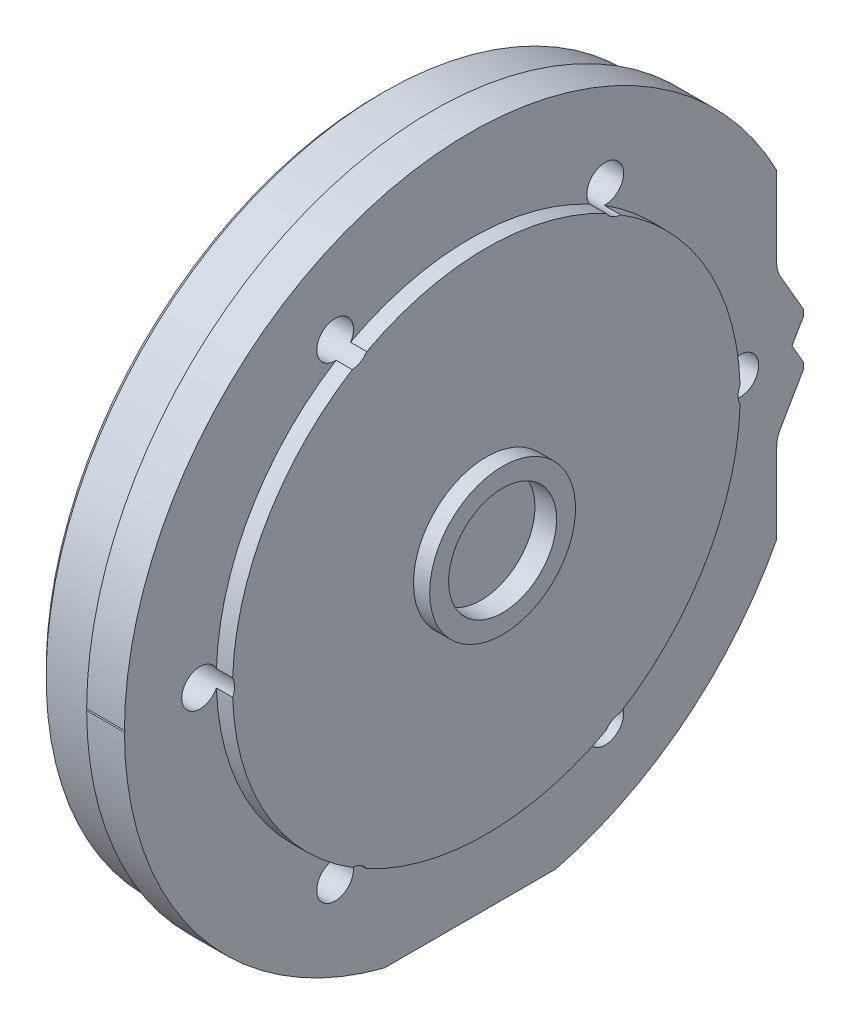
ISO-10303-21;
HEADER;
FILE_DESCRIPTION(('STEP AP214'),'2;1');
FILE_NAME('part.step','',(''),(''),'','','');
FILE_SCHEMA(('AUTOMOTIVE_DESIGN { 1 0 10303 214 1 1 1 1 }'));
ENDSEC;
DATA;
#1=APPLICATION_CONTEXT('core data for automotive mechanical design processes');
#2=APPLICATION_PROTOCOL_DEFINITION('international standard','automotive_design',2000,#1);
#3=PRODUCT_CONTEXT('',#1,'mechanical');
#4=PRODUCT('Part','Part','',(#3));
#5=PRODUCT_RELATED_PRODUCT_CATEGORY('part','',(#4));
#6=PRODUCT_DEFINITION_FORMATION('','',#4);
#7=PRODUCT_DEFINITION_CONTEXT('part definition',#1,'design');
#8=PRODUCT_DEFINITION('design','',#6,#7);
#9=PRODUCT_DEFINITION_SHAPE('','',#8);
#10=(LENGTH_UNIT() NAMED_UNIT(*) SI_UNIT(.MILLI.,.METRE.));
#11=(NAMED_UNIT(*) PLANE_ANGLE_UNIT() SI_UNIT($,.RADIAN.));
#12=(NAMED_UNIT(*) SI_UNIT($,.STERADIAN.) SOLID_ANGLE_UNIT());
#13=UNCERTAINTY_MEASURE_WITH_UNIT(LENGTH_MEASURE(1.E-05),#10,'distance_accuracy_value','');
#14=(GEOMETRIC_REPRESENTATION_CONTEXT(3) GLOBAL_UNCERTAINTY_ASSIGNED_CONTEXT((#13)) GLOBAL_UNIT_ASSIGNED_CONTEXT((#10,
#11,#12)) REPRESENTATION_CONTEXT('',''));
#15=CARTESIAN_POINT('',(0.,0.,0.));
#16=DIRECTION('',(0.,0.,1.));
#17=DIRECTION('',(1.,0.,0.));
#18=AXIS2_PLACEMENT_3D('',#15,#16,#17);
#19=CARTESIAN_POINT('',(0.,0.,0.));
#20=DIRECTION('',(-1.,0.,0.));
#21=DIRECTION('',(0.,0.,1.));
#22=AXIS2_PLACEMENT_3D('',#19,#20,#21);
#23=CYLINDRICAL_SURFACE('',#22,64.);
#24=DIRECTION('',(-1.,0.,0.));
#25=VECTOR('',#24,1.);
#26=CARTESIAN_POINT('',(76.6180551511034,-29.5877930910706,-56.75));
#27=LINE('',#26,#25);
#28=CARTESIAN_POINT('',(17.,-29.5877930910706,-56.75));
#29=VERTEX_POINT('',#28);
#30=CARTESIAN_POINT('',(10.,-29.5877930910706,-56.75));
#31=VERTEX_POINT('',#30);
#32=EDGE_CURVE('E284',#29,#31,#27,.T.);
#33=ORIENTED_EDGE('',*,*,#32,.F.);
#34=CARTESIAN_POINT('',(17.,0.,0.));
#35=DIRECTION('',(-1.,0.,0.));
#36=DIRECTION('',(0.,0.,1.));
#37=AXIS2_PLACEMENT_3D('',#34,#35,#36);
#38=CIRCLE('',#37,64.);
#39=CARTESIAN_POINT('',(17.,-62.,-15.8745078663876));
#40=VERTEX_POINT('',#39);
#41=EDGE_CURVE('E467',#29,#40,#38,.T.);
#42=ORIENTED_EDGE('',*,*,#41,.T.);
#43=DIRECTION('',(-1.,0.,0.));
#44=VECTOR('',#43,1.);
#45=CARTESIAN_POINT('',(0.,-62.,-15.8745078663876));
#46=LINE('',#45,#44);
#47=CARTESIAN_POINT('',(10.,-62.,-15.8745078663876));
#48=VERTEX_POINT('',#47);
#49=EDGE_CURVE('E356',#40,#48,#46,.T.);
#50=ORIENTED_EDGE('',*,*,#49,.T.);
#51=CARTESIAN_POINT('',(10.,0.,0.));
#52=DIRECTION('',(-1.,0.,0.));
#53=DIRECTION('',(0.,0.,1.));
#54=AXIS2_PLACEMENT_3D('',#51,#52,#53);
#55=CIRCLE('',#54,64.);
#56=EDGE_CURVE('E472',#31,#48,#55,.T.);
#57=ORIENTED_EDGE('',*,*,#56,.F.);
#58=EDGE_LOOP('',(#33,#42,#50,#57));
#59=FACE_BOUND('',#58,.T.);
#60=ADVANCED_FACE('F16',(#59),#23,.T.);
#61=DIRECTION('',(-1.,0.,0.));
#62=VECTOR('',#61,1.);
#63=CARTESIAN_POINT('',(76.6180551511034,29.5877930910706,-56.75));
#64=LINE('',#63,#62);
#65=CARTESIAN_POINT('',(17.,29.5877930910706,-56.75));
#66=VERTEX_POINT('',#65);
#67=CARTESIAN_POINT('',(10.,29.5877930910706,-56.75));
#68=VERTEX_POINT('',#67);
#69=EDGE_CURVE('E295',#66,#68,#64,.T.);
#70=ORIENTED_EDGE('',*,*,#69,.T.);
#71=CARTESIAN_POINT('',(10.,0.15,63.9998242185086));
#72=VERTEX_POINT('',#71);
#73=EDGE_CURVE('E478',#72,#68,#55,.T.);
#74=ORIENTED_EDGE('',*,*,#73,.F.);
#75=DIRECTION('',(1.,0.,0.));
#76=VECTOR('',#75,1.);
#77=CARTESIAN_POINT('',(0.,0.15,63.9998242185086));
#78=LINE('',#77,#76);
#79=CARTESIAN_POINT('',(17.,0.15,63.9998242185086));
#80=VERTEX_POINT('',#79);
#81=EDGE_CURVE('E329',#72,#80,#78,.T.);
#82=ORIENTED_EDGE('',*,*,#81,.T.);
#83=EDGE_CURVE('E473',#80,#66,#38,.T.);
#84=ORIENTED_EDGE('',*,*,#83,.T.);
#85=EDGE_LOOP('',(#70,#74,#82,#84));
#86=FACE_BOUND('',#85,.T.);
#87=ADVANCED_FACE('F647',(#86),#23,.T.);
#88=CARTESIAN_POINT('',(0.,0.,0.));
#89=DIRECTION('',(1.,0.,0.));
#90=DIRECTION('',(0.,0.,-1.));
#91=AXIS2_PLACEMENT_3D('',#88,#89,#90);
#92=PLANE('',#91);
#93=CARTESIAN_POINT('',(0.,0.,0.));
#94=DIRECTION('',(1.,0.,0.));
#95=DIRECTION('',(0.,0.,-1.));
#96=AXIS2_PLACEMENT_3D('',#93,#94,#95);
#97=CIRCLE('',#96,32.5);
#98=CARTESIAN_POINT('',(0.,0.,-32.5));
#99=VERTEX_POINT('',#98);
#100=EDGE_CURVE('E485',#99,#99,#97,.T.);
#101=ORIENTED_EDGE('',*,*,#100,.T.);
#102=EDGE_LOOP('',(#101));
#103=FACE_BOUND('',#102,.T.);
#104=CARTESIAN_POINT('',(0.,50.,0.));
#105=DIRECTION('',(-1.,0.,0.));
#106=DIRECTION('',(0.,0.,1.));
#107=AXIS2_PLACEMENT_3D('',#104,#105,#106);
#108=CIRCLE('',#107,4.);
#109=CARTESIAN_POINT('',(0.,50.,4.));
#110=VERTEX_POINT('',#109);
#111=EDGE_CURVE('E431',#110,#110,#108,.T.);
#112=ORIENTED_EDGE('',*,*,#111,.F.);
#113=EDGE_LOOP('',(#112));
#114=FACE_BOUND('',#113,.T.);
#115=CARTESIAN_POINT('',(0.,0.,-50.));
#116=DIRECTION('',(-1.,0.,0.));
#117=DIRECTION('',(0.,0.,1.));
#118=AXIS2_PLACEMENT_3D('',#115,#116,#117);
#119=CIRCLE('',#118,3.4);
#120=CARTESIAN_POINT('',(0.,0.,-46.6));
#121=VERTEX_POINT('',#120);
#122=EDGE_CURVE('E419',#121,#121,#119,.T.);
#123=ORIENTED_EDGE('',*,*,#122,.F.);
#124=EDGE_LOOP('',(#123));
#125=FACE_BOUND('',#124,.T.);
#126=CARTESIAN_POINT('',(0.,43.301270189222,-25.));
#127=DIRECTION('',(-1.,0.,0.));
#128=DIRECTION('',(0.,0.,1.));
#129=AXIS2_PLACEMENT_3D('',#126,#127,#128);
#130=CIRCLE('',#129,3.4);
#131=CARTESIAN_POINT('',(0.,43.301270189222,-21.6));
#132=VERTEX_POINT('',#131);
#133=EDGE_CURVE('E407',#132,#132,#130,.T.);
#134=ORIENTED_EDGE('',*,*,#133,.F.);
#135=EDGE_LOOP('',(#134));
#136=FACE_BOUND('',#135,.T.);
#137=CARTESIAN_POINT('',(0.,43.3012701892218,25.));
#138=DIRECTION('',(-1.,0.,0.));
#139=DIRECTION('',(0.,0.,1.));
#140=AXIS2_PLACEMENT_3D('',#137,#138,#139);
#141=CIRCLE('',#140,3.4);
#142=CARTESIAN_POINT('',(0.,43.3012701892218,28.4));
#143=VERTEX_POINT('',#142);
#144=EDGE_CURVE('E395',#143,#143,#141,.T.);
#145=ORIENTED_EDGE('',*,*,#144,.F.);
#146=EDGE_LOOP('',(#145));
#147=FACE_BOUND('',#146,.T.);
#148=CARTESIAN_POINT('',(0.,-3.49148336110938E-13,50.));
#149=DIRECTION('',(-1.,0.,0.));
#150=DIRECTION('',(0.,0.,1.));
#151=AXIS2_PLACEMENT_3D('',#148,#149,#150);
#152=CIRCLE('',#151,3.4);
#153=CARTESIAN_POINT('',(0.,-3.49148336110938E-13,53.4));
#154=VERTEX_POINT('',#153);
#155=EDGE_CURVE('E383',#154,#154,#152,.T.);
#156=ORIENTED_EDGE('',*,*,#155,.F.);
#157=EDGE_LOOP('',(#156));
#158=FACE_BOUND('',#157,.T.);
#159=CARTESIAN_POINT('',(0.,-43.3012701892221,24.9999999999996));
#160=DIRECTION('',(-1.,0.,0.));
#161=DIRECTION('',(0.,0.,1.));
#162=AXIS2_PLACEMENT_3D('',#159,#160,#161);
#163=CIRCLE('',#162,3.4);
#164=CARTESIAN_POINT('',(0.,-43.3012701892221,28.3999999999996));
#165=VERTEX_POINT('',#164);
#166=EDGE_CURVE('E371',#165,#165,#163,.T.);
#167=ORIENTED_EDGE('',*,*,#166,.F.);
#168=EDGE_LOOP('',(#167));
#169=FACE_BOUND('',#168,.T.);
#170=CARTESIAN_POINT('',(0.,-43.3012701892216,-25.0000000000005));
#171=DIRECTION('',(-1.,0.,0.));
#172=DIRECTION('',(0.,0.,1.));
#173=AXIS2_PLACEMENT_3D('',#170,#171,#172);
#174=CIRCLE('',#173,3.4);
#175=CARTESIAN_POINT('',(0.,-43.3012701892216,-21.6000000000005));
#176=VERTEX_POINT('',#175);
#177=EDGE_CURVE('E359',#176,#176,#174,.T.);
#178=ORIENTED_EDGE('',*,*,#177,.F.);
#179=EDGE_LOOP('',(#178));
#180=FACE_BOUND('',#179,.T.);
#181=DIRECTION('',(0.,-0.866025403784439,0.5));
#182=VECTOR('',#181,1.);
#183=CARTESIAN_POINT('',(0.,-4.75,-61.75));
#184=LINE('',#183,#182);
#185=CARTESIAN_POINT('',(0.,-5.6303549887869,-61.2417268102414));
#186=VERTEX_POINT('',#185);
#187=CARTESIAN_POINT('',(0.,-12.25,-57.4198729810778));
#188=VERTEX_POINT('',#187);
#189=EDGE_CURVE('E268',#186,#188,#184,.T.);
#190=ORIENTED_EDGE('',*,*,#189,.T.);
#191=CARTESIAN_POINT('',(0.,-14.75,-61.75));
#192=DIRECTION('',(1.,0.,0.));
#193=DIRECTION('',(0.,0.,-1.));
#194=AXIS2_PLACEMENT_3D('',#191,#192,#193);
#195=CIRCLE('',#194,5.);
#196=CARTESIAN_POINT('',(0.,-14.75,-56.75));
#197=VERTEX_POINT('',#196);
#198=EDGE_CURVE('E755',#188,#197,#195,.T.);
#199=ORIENTED_EDGE('',*,*,#198,.T.);
#200=DIRECTION('',(0.,-1.,0.));
#201=VECTOR('',#200,1.);
#202=CARTESIAN_POINT('',(0.,-13.4102540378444,-56.75));
#203=LINE('',#202,#201);
#204=CARTESIAN_POINT('',(0.,-23.6999472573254,-56.75));
#205=VERTEX_POINT('',#204);
#206=EDGE_CURVE('E282',#197,#205,#203,.T.);
#207=ORIENTED_EDGE('',*,*,#206,.T.);
#208=CARTESIAN_POINT('',(0.,0.,0.));
#209=DIRECTION('',(1.,0.,0.));
#210=DIRECTION('',(0.,0.,-1.));
#211=AXIS2_PLACEMENT_3D('',#208,#209,#210);
#212=CIRCLE('',#211,61.5);
#213=CARTESIAN_POINT('',(0.,23.6999472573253,-56.75));
#214=VERTEX_POINT('',#213);
#215=EDGE_CURVE('E491',#205,#214,#212,.F.);
#216=ORIENTED_EDGE('',*,*,#215,.T.);
#217=DIRECTION('',(0.,-1.,0.));
#218=VECTOR('',#217,1.);
#219=CARTESIAN_POINT('',(0.,29.5877930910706,-56.75));
#220=LINE('',#219,#218);
#221=CARTESIAN_POINT('',(0.,14.75,-56.75));
#222=VERTEX_POINT('',#221);
#223=EDGE_CURVE('E277',#214,#222,#220,.T.);
#224=ORIENTED_EDGE('',*,*,#223,.T.);
#225=CARTESIAN_POINT('',(0.,14.75,-61.75));
#226=DIRECTION('',(1.,0.,0.));
#227=DIRECTION('',(0.,0.,-1.));
#228=AXIS2_PLACEMENT_3D('',#225,#226,#227);
#229=CIRCLE('',#228,5.);
#230=CARTESIAN_POINT('',(0.,12.25,-57.4198729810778));
#231=VERTEX_POINT('',#230);
#232=EDGE_CURVE('E24',#222,#231,#229,.T.);
#233=ORIENTED_EDGE('',*,*,#232,.T.);
#234=DIRECTION('',(0.,-0.866025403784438,-0.5));
#235=VECTOR('',#234,1.);
#236=CARTESIAN_POINT('',(0.,13.4102540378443,-56.75));
#237=LINE('',#236,#235);
#238=CARTESIAN_POINT('',(0.,5.63035498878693,-61.2417268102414));
#239=VERTEX_POINT('',#238);
#240=EDGE_CURVE('E275',#231,#239,#237,.T.);
#241=ORIENTED_EDGE('',*,*,#240,.T.);
#242=CARTESIAN_POINT('',(0.,3.17494503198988,-61.4179918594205));
#243=VERTEX_POINT('',#242);
#244=EDGE_CURVE('E274',#239,#243,#212,.F.);
#245=ORIENTED_EDGE('',*,*,#244,.T.);
#246=DIRECTION('',(0.,-0.866025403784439,0.5));
#247=VECTOR('',#246,1.);
#248=CARTESIAN_POINT('',(0.,3.75,-61.75));
#249=LINE('',#248,#247);
#250=CARTESIAN_POINT('',(0.,0.,-59.5849364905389));
#251=VERTEX_POINT('',#250);
#252=EDGE_CURVE('E251',#243,#251,#249,.T.);
#253=ORIENTED_EDGE('',*,*,#252,.T.);
#254=DIRECTION('',(0.,-0.866025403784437,-0.5));
#255=VECTOR('',#254,1.);
#256=CARTESIAN_POINT('',(0.,0.,-59.5849364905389));
#257=LINE('',#256,#255);
#258=CARTESIAN_POINT('',(0.,-3.17494503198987,-61.4179918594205));
#259=VERTEX_POINT('',#258);
#260=EDGE_CURVE('E261',#251,#259,#257,.T.);
#261=ORIENTED_EDGE('',*,*,#260,.T.);
#262=EDGE_CURVE('E488',#259,#186,#212,.F.);
#263=ORIENTED_EDGE('',*,*,#262,.T.);
#264=EDGE_LOOP('',(#190,#199,#207,#216,#224,#233,#241,#245,#253,#261,#263));
#265=FACE_BOUND('',#264,.T.);
#266=ADVANCED_FACE('F272',(#103,#114,#125,#136,#147,#158,#169,#180,#265),#92,.F.);
#267=CARTESIAN_POINT('',(0.,0.,0.));
#268=DIRECTION('',(-1.,0.,0.));
#269=DIRECTION('',(0.,0.,1.));
#270=AXIS2_PLACEMENT_3D('',#267,#268,#269);
#271=CYLINDRICAL_SURFACE('',#270,62.5);
#272=DIRECTION('',(-1.,0.,0.));
#273=VECTOR('',#272,1.);
#274=CARTESIAN_POINT('',(0.,-26.1856353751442,-56.75));
#275=LINE('',#274,#273);
#276=CARTESIAN_POINT('',(10.,-26.1856353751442,-56.75));
#277=VERTEX_POINT('',#276);
#278=CARTESIAN_POINT('',(1.00000000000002,-26.1856353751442,-56.75));
#279=VERTEX_POINT('',#278);
#280=EDGE_CURVE('E307',#277,#279,#275,.T.);
#281=ORIENTED_EDGE('',*,*,#280,.F.);
#282=CARTESIAN_POINT('',(10.,0.,0.));
#283=DIRECTION('',(-1.,0.,0.));
#284=DIRECTION('',(0.,0.,1.));
#285=AXIS2_PLACEMENT_3D('',#282,#283,#284);
#286=CIRCLE('',#285,62.5);
#287=CARTESIAN_POINT('',(10.,-62.,-7.88986691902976));
#288=VERTEX_POINT('',#287);
#289=EDGE_CURVE('E477',#277,#288,#286,.T.);
#290=ORIENTED_EDGE('',*,*,#289,.T.);
#291=DIRECTION('',(-1.,0.,0.));
#292=VECTOR('',#291,1.);
#293=CARTESIAN_POINT('',(0.,-62.,-7.88986691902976));
#294=LINE('',#293,#292);
#295=CARTESIAN_POINT('',(1.,-62.,-7.88986691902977));
#296=VERTEX_POINT('',#295);
#297=EDGE_CURVE('E346',#288,#296,#294,.T.);
#298=ORIENTED_EDGE('',*,*,#297,.T.);
#299=CARTESIAN_POINT('',(1.00000000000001,0.,0.));
#300=DIRECTION('',(1.,0.,0.));
#301=DIRECTION('',(0.,0.,-1.));
#302=AXIS2_PLACEMENT_3D('',#299,#300,#301);
#303=CIRCLE('',#302,62.5);
#304=EDGE_CURVE('E492',#296,#279,#303,.T.);
#305=ORIENTED_EDGE('',*,*,#304,.T.);
#306=EDGE_LOOP('',(#281,#290,#298,#305));
#307=FACE_BOUND('',#306,.T.);
#308=ADVANCED_FACE('F707',(#307),#271,.T.);
#309=DIRECTION('',(-1.,0.,0.));
#310=VECTOR('',#309,1.);
#311=CARTESIAN_POINT('',(0.,26.1856353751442,-56.75));
#312=LINE('',#311,#310);
#313=CARTESIAN_POINT('',(1.00000000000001,26.1856353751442,-56.75));
#314=VERTEX_POINT('',#313);
#315=CARTESIAN_POINT('',(10.,26.1856353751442,-56.75));
#316=VERTEX_POINT('',#315);
#317=EDGE_CURVE('E302',#314,#316,#312,.F.);
#318=ORIENTED_EDGE('',*,*,#317,.F.);
#319=CARTESIAN_POINT('',(1.00000000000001,-62.,7.88986691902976));
#320=VERTEX_POINT('',#319);
#321=EDGE_CURVE('E490',#314,#320,#303,.T.);
#322=ORIENTED_EDGE('',*,*,#321,.T.);
#323=DIRECTION('',(-1.,0.,0.));
#324=VECTOR('',#323,1.);
#325=CARTESIAN_POINT('',(0.,-62.,7.88986691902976));
#326=LINE('',#325,#324);
#327=CARTESIAN_POINT('',(10.,-62.,7.88986691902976));
#328=VERTEX_POINT('',#327);
#329=EDGE_CURVE('E343',#320,#328,#326,.F.);
#330=ORIENTED_EDGE('',*,*,#329,.T.);
#331=EDGE_CURVE('E479',#328,#316,#286,.T.);
#332=ORIENTED_EDGE('',*,*,#331,.T.);
#333=EDGE_LOOP('',(#318,#322,#330,#332));
#334=FACE_BOUND('',#333,.T.);
#335=ADVANCED_FACE('F695',(#334),#271,.T.);
#336=CARTESIAN_POINT('',(10.,62.5,0.));
#337=DIRECTION('',(1.,0.,0.));
#338=DIRECTION('',(0.,0.,-1.));
#339=AXIS2_PLACEMENT_3D('',#336,#337,#338);
#340=PLANE('',#339);
#341=DIRECTION('',(0.,1.,0.));
#342=VECTOR('',#341,1.);
#343=CARTESIAN_POINT('',(10.,62.5,-56.75));
#344=LINE('',#343,#342);
#345=EDGE_CURVE('E309',#31,#277,#344,.T.);
#346=ORIENTED_EDGE('',*,*,#345,.F.);
#347=ORIENTED_EDGE('',*,*,#56,.T.);
#348=DIRECTION('',(0.,0.,1.));
#349=VECTOR('',#348,1.);
#350=CARTESIAN_POINT('',(10.,-62.,0.));
#351=LINE('',#350,#349);
#352=EDGE_CURVE('E352',#48,#288,#351,.T.);
#353=ORIENTED_EDGE('',*,*,#352,.T.);
#354=ORIENTED_EDGE('',*,*,#289,.F.);
#355=EDGE_LOOP('',(#346,#347,#353,#354));
#356=FACE_BOUND('',#355,.T.);
#357=ADVANCED_FACE('F711',(#356),#340,.F.);
#358=DIRECTION('',(0.,1.,0.));
#359=VECTOR('',#358,1.);
#360=CARTESIAN_POINT('',(10.,62.5,-56.75));
#361=LINE('',#360,#359);
#362=EDGE_CURVE('E304',#316,#68,#361,.T.);
#363=ORIENTED_EDGE('',*,*,#362,.F.);
#364=ORIENTED_EDGE('',*,*,#331,.F.);
#365=CARTESIAN_POINT('',(10.,-62.,15.8745078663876));
#366=VERTEX_POINT('',#365);
#367=EDGE_CURVE('E349',#328,#366,#351,.T.);
#368=ORIENTED_EDGE('',*,*,#367,.T.);
#369=CARTESIAN_POINT('',(10.,-0.15,63.9998242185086));
#370=VERTEX_POINT('',#369);
#371=EDGE_CURVE('E474',#366,#370,#55,.T.);
#372=ORIENTED_EDGE('',*,*,#371,.T.);
#373=DIRECTION('',(0.,0.499999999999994,-0.866025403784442));
#374=VECTOR('',#373,1.);
#375=CARTESIAN_POINT('',(10.,43.2252368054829,-11.1282897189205));
#376=LINE('',#375,#374);
#377=CARTESIAN_POINT('',(10.,0.,63.7400165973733));
#378=VERTEX_POINT('',#377);
#379=EDGE_CURVE('E332',#370,#378,#376,.T.);
#380=ORIENTED_EDGE('',*,*,#379,.T.);
#381=DIRECTION('',(0.,0.499999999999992,0.866025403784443));
#382=VECTOR('',#381,1.);
#383=CARTESIAN_POINT('',(10.,-11.9752368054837,42.9982980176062));
#384=LINE('',#383,#382);
#385=EDGE_CURVE('E338',#378,#72,#384,.T.);
#386=ORIENTED_EDGE('',*,*,#385,.T.);
#387=ORIENTED_EDGE('',*,*,#73,.T.);
#388=EDGE_LOOP('',(#363,#364,#368,#372,#380,#386,#387));
#389=FACE_BOUND('',#388,.T.);
#390=ADVANCED_FACE('F686',(#389),#340,.F.);
#391=CARTESIAN_POINT('',(17.,64.,0.));
#392=DIRECTION('',(-1.,0.,0.));
#393=DIRECTION('',(0.,0.,1.));
#394=AXIS2_PLACEMENT_3D('',#391,#392,#393);
#395=PLANE('',#394);
#396=CARTESIAN_POINT('',(17.,0.,0.));
#397=DIRECTION('',(-1.,0.,0.));
#398=DIRECTION('',(0.,0.,1.));
#399=AXIS2_PLACEMENT_3D('',#396,#397,#398);
#400=CIRCLE('',#399,47.);
#401=CARTESIAN_POINT('',(17.,-1.55104630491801,-46.9744));
#402=VERTEX_POINT('',#401);
#403=CARTESIAN_POINT('',(17.,-39.9055005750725,-24.8304455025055));
#404=VERTEX_POINT('',#403);
#405=EDGE_CURVE('E464',#402,#404,#400,.T.);
#406=ORIENTED_EDGE('',*,*,#405,.T.);
#407=CARTESIAN_POINT('',(17.,-43.3012701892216,-25.0000000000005));
#408=DIRECTION('',(-1.,0.,0.));
#409=DIRECTION('',(0.,0.,1.));
#410=AXIS2_PLACEMENT_3D('',#407,#408,#409);
#411=CIRCLE('',#410,3.4);
#412=CARTESIAN_POINT('',(17.,-41.4565468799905,-22.1439544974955));
#413=VERTEX_POINT('',#412);
#414=EDGE_CURVE('E368',#404,#413,#411,.T.);
#415=ORIENTED_EDGE('',*,*,#414,.T.);
#416=CARTESIAN_POINT('',(17.,-41.456546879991,22.1439544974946));
#417=VERTEX_POINT('',#416);
#418=EDGE_CURVE('E468',#413,#417,#400,.T.);
#419=ORIENTED_EDGE('',*,*,#418,.T.);
#420=CARTESIAN_POINT('',(17.,-43.3012701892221,24.9999999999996));
#421=DIRECTION('',(-1.,0.,0.));
#422=DIRECTION('',(0.,0.,1.));
#423=AXIS2_PLACEMENT_3D('',#420,#421,#422);
#424=CIRCLE('',#423,3.4);
#425=CARTESIAN_POINT('',(17.,-39.9055005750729,24.8304455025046));
#426=VERTEX_POINT('',#425);
#427=EDGE_CURVE('E380',#417,#426,#424,.T.);
#428=ORIENTED_EDGE('',*,*,#427,.T.);
#429=CARTESIAN_POINT('',(17.,-1.55104630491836,46.9744));
#430=VERTEX_POINT('',#429);
#431=EDGE_CURVE('E1088',#426,#430,#400,.T.);
#432=ORIENTED_EDGE('',*,*,#431,.T.);
#433=CARTESIAN_POINT('',(17.,-3.49148336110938E-13,50.));
#434=DIRECTION('',(-1.,0.,0.));
#435=DIRECTION('',(0.,0.,1.));
#436=AXIS2_PLACEMENT_3D('',#433,#434,#435);
#437=CIRCLE('',#436,3.4);
#438=CARTESIAN_POINT('',(17.,1.5510463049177,46.9744));
#439=VERTEX_POINT('',#438);
#440=EDGE_CURVE('E392',#430,#439,#437,.T.);
#441=ORIENTED_EDGE('',*,*,#440,.T.);
#442=CARTESIAN_POINT('',(17.,39.9055005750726,24.8304455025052));
#443=VERTEX_POINT('',#442);
#444=EDGE_CURVE('E1086',#439,#443,#400,.T.);
#445=ORIENTED_EDGE('',*,*,#444,.T.);
#446=CARTESIAN_POINT('',(17.,43.3012701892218,25.));
#447=DIRECTION('',(-1.,0.,0.));
#448=DIRECTION('',(0.,0.,1.));
#449=AXIS2_PLACEMENT_3D('',#446,#447,#448);
#450=CIRCLE('',#449,3.4);
#451=CARTESIAN_POINT('',(17.,41.4565468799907,22.1439544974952));
#452=VERTEX_POINT('',#451);
#453=EDGE_CURVE('E404',#443,#452,#450,.T.);
#454=ORIENTED_EDGE('',*,*,#453,.T.);
#455=CARTESIAN_POINT('',(17.,41.4565468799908,-22.1439544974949));
#456=VERTEX_POINT('',#455);
#457=EDGE_CURVE('E1085',#452,#456,#400,.T.);
#458=ORIENTED_EDGE('',*,*,#457,.T.);
#459=CARTESIAN_POINT('',(17.,43.301270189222,-25.));
#460=DIRECTION('',(-1.,0.,0.));
#461=DIRECTION('',(0.,0.,1.));
#462=AXIS2_PLACEMENT_3D('',#459,#460,#461);
#463=CIRCLE('',#462,3.4);
#464=CARTESIAN_POINT('',(17.,39.9055005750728,-24.8304455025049));
#465=VERTEX_POINT('',#464);
#466=EDGE_CURVE('E416',#456,#465,#463,.T.);
#467=ORIENTED_EDGE('',*,*,#466,.T.);
#468=CARTESIAN_POINT('',(17.,1.55104630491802,-46.9744));
#469=VERTEX_POINT('',#468);
#470=EDGE_CURVE('E462',#465,#469,#400,.T.);
#471=ORIENTED_EDGE('',*,*,#470,.T.);
#472=CARTESIAN_POINT('',(17.,0.,-50.));
#473=DIRECTION('',(-1.,0.,0.));
#474=DIRECTION('',(0.,0.,1.));
#475=AXIS2_PLACEMENT_3D('',#472,#473,#474);
#476=CIRCLE('',#475,3.4);
#477=EDGE_CURVE('E428',#469,#402,#476,.T.);
#478=ORIENTED_EDGE('',*,*,#477,.T.);
#479=EDGE_LOOP('',(#406,#415,#419,#428,#432,#441,#445,#454,#458,#467,#471,#478));
#480=FACE_BOUND('',#479,.T.);
#481=DIRECTION('',(0.,1.,0.));
#482=VECTOR('',#481,1.);
#483=CARTESIAN_POINT('',(17.,-13.4102540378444,-56.75));
#484=LINE('',#483,#482);
#485=CARTESIAN_POINT('',(17.,-14.75,-56.75));
#486=VERTEX_POINT('',#485);
#487=EDGE_CURVE('E298',#29,#486,#484,.T.);
#488=ORIENTED_EDGE('',*,*,#487,.T.);
#489=CARTESIAN_POINT('',(17.,-14.75,-61.75));
#490=DIRECTION('',(-1.,0.,0.));
#491=DIRECTION('',(0.,0.,1.));
#492=AXIS2_PLACEMENT_3D('',#489,#490,#491);
#493=CIRCLE('',#492,5.);
#494=CARTESIAN_POINT('',(17.,-12.25,-57.4198729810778));
#495=VERTEX_POINT('',#494);
#496=EDGE_CURVE('E757',#486,#495,#493,.T.);
#497=ORIENTED_EDGE('',*,*,#496,.T.);
#498=DIRECTION('',(0.,0.866025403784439,-0.5));
#499=VECTOR('',#498,1.);
#500=CARTESIAN_POINT('',(17.,-4.75,-61.75));
#501=LINE('',#500,#499);
#502=CARTESIAN_POINT('',(17.,-4.75,-61.75));
#503=VERTEX_POINT('',#502);
#504=EDGE_CURVE('E301',#495,#503,#501,.T.);
#505=ORIENTED_EDGE('',*,*,#504,.T.);
#506=DIRECTION('',(0.,1.,0.));
#507=VECTOR('',#506,1.);
#508=CARTESIAN_POINT('',(17.,-3.75,-61.75));
#509=LINE('',#508,#507);
#510=CARTESIAN_POINT('',(17.,-3.75,-61.75));
#511=VERTEX_POINT('',#510);
#512=EDGE_CURVE('E733',#503,#511,#509,.T.);
#513=ORIENTED_EDGE('',*,*,#512,.T.);
#514=DIRECTION('',(0.,0.866025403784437,0.5));
#515=VECTOR('',#514,1.);
#516=CARTESIAN_POINT('',(17.,0.,-59.5849364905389));
#517=LINE('',#516,#515);
#518=CARTESIAN_POINT('',(17.,0.,-59.5849364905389));
#519=VERTEX_POINT('',#518);
#520=EDGE_CURVE('E732',#511,#519,#517,.T.);
#521=ORIENTED_EDGE('',*,*,#520,.T.);
#522=DIRECTION('',(0.,0.866025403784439,-0.5));
#523=VECTOR('',#522,1.);
#524=CARTESIAN_POINT('',(17.,3.75,-61.75));
#525=LINE('',#524,#523);
#526=CARTESIAN_POINT('',(17.,3.75,-61.75));
#527=VERTEX_POINT('',#526);
#528=EDGE_CURVE('E254',#519,#527,#525,.T.);
#529=ORIENTED_EDGE('',*,*,#528,.T.);
#530=DIRECTION('',(0.,1.,0.));
#531=VECTOR('',#530,1.);
#532=CARTESIAN_POINT('',(17.,4.75,-61.75));
#533=LINE('',#532,#531);
#534=CARTESIAN_POINT('',(17.,4.75,-61.75));
#535=VERTEX_POINT('',#534);
#536=EDGE_CURVE('E735',#527,#535,#533,.T.);
#537=ORIENTED_EDGE('',*,*,#536,.T.);
#538=DIRECTION('',(0.,0.866025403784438,0.5));
#539=VECTOR('',#538,1.);
#540=CARTESIAN_POINT('',(17.,13.4102540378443,-56.75));
#541=LINE('',#540,#539);
#542=CARTESIAN_POINT('',(17.,12.25,-57.4198729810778));
#543=VERTEX_POINT('',#542);
#544=EDGE_CURVE('E720',#535,#543,#541,.T.);
#545=ORIENTED_EDGE('',*,*,#544,.T.);
#546=CARTESIAN_POINT('',(17.,14.75,-61.75));
#547=DIRECTION('',(-1.,0.,0.));
#548=DIRECTION('',(0.,0.,1.));
#549=AXIS2_PLACEMENT_3D('',#546,#547,#548);
#550=CIRCLE('',#549,5.);
#551=CARTESIAN_POINT('',(17.,14.75,-56.75));
#552=VERTEX_POINT('',#551);
#553=EDGE_CURVE('E11',#543,#552,#550,.T.);
#554=ORIENTED_EDGE('',*,*,#553,.T.);
#555=DIRECTION('',(0.,1.,0.));
#556=VECTOR('',#555,1.);
#557=CARTESIAN_POINT('',(17.,29.5877930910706,-56.75));
#558=LINE('',#557,#556);
#559=EDGE_CURVE('E305',#552,#66,#558,.T.);
#560=ORIENTED_EDGE('',*,*,#559,.T.);
#561=ORIENTED_EDGE('',*,*,#83,.F.);
#562=DIRECTION('',(0.,0.499999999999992,0.866025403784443));
#563=VECTOR('',#562,1.);
#564=CARTESIAN_POINT('',(17.,0.15,63.9998242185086));
#565=LINE('',#564,#563);
#566=CARTESIAN_POINT('',(17.,0.,63.7400165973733));
#567=VERTEX_POINT('',#566);
#568=EDGE_CURVE('E326',#567,#80,#565,.T.);
#569=ORIENTED_EDGE('',*,*,#568,.F.);
#570=DIRECTION('',(0.,0.499999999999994,-0.866025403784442));
#571=VECTOR('',#570,1.);
#572=CARTESIAN_POINT('',(17.,0.,63.7400165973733));
#573=LINE('',#572,#571);
#574=CARTESIAN_POINT('',(17.,-0.15,63.9998242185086));
#575=VERTEX_POINT('',#574);
#576=EDGE_CURVE('E321',#575,#567,#573,.T.);
#577=ORIENTED_EDGE('',*,*,#576,.F.);
#578=CARTESIAN_POINT('',(17.,-62.,15.8745078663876));
#579=VERTEX_POINT('',#578);
#580=EDGE_CURVE('E469',#579,#575,#38,.T.);
#581=ORIENTED_EDGE('',*,*,#580,.F.);
#582=DIRECTION('',(0.,0.,1.));
#583=VECTOR('',#582,1.);
#584=CARTESIAN_POINT('',(17.,-62.,25.));
#585=LINE('',#584,#583);
#586=EDGE_CURVE('E341',#40,#579,#585,.T.);
#587=ORIENTED_EDGE('',*,*,#586,.F.);
#588=ORIENTED_EDGE('',*,*,#41,.F.);
#589=EDGE_LOOP('',(#488,#497,#505,#513,#521,#529,#537,#545,#554,#560,#561,#569,#577,#581,#587,#588));
#590=FACE_BOUND('',#589,.T.);
#591=ADVANCED_FACE('F536',(#480,#590),#395,.F.);
#592=CARTESIAN_POINT('',(0.,0.,0.));
#593=DIRECTION('',(1.,0.,0.));
#594=DIRECTION('',(0.,0.,-1.));
#595=AXIS2_PLACEMENT_3D('',#592,#593,#594);
#596=CONICAL_SURFACE('',#595,61.5,0.785398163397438);
#597=ORIENTED_EDGE('',*,*,#215,.F.);
#598=CARTESIAN_POINT('',(-4.69743500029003,-2.44313129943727,-56.75));
#599=CARTESIAN_POINT('',(-4.67805297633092,-2.89386948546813,-56.75));
#600=CARTESIAN_POINT('',(-4.65331647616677,-3.34435908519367,-56.75));
#601=CARTESIAN_POINT('',(-4.5932543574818,-4.24462286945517,-56.75));
#602=CARTESIAN_POINT('',(-4.55792895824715,-4.69439706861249,-56.75));
#603=CARTESIAN_POINT('',(-4.43627055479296,-6.04209308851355,-56.75));
#604=CARTESIAN_POINT('',(-4.33424424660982,-6.938643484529,-56.75));
#605=CARTESIAN_POINT('',(-4.09006234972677,-8.72467418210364,-56.75));
#606=CARTESIAN_POINT('',(-3.94797420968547,-9.6141638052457,-56.75));
#607=CARTESIAN_POINT('',(-3.62557446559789,-11.3862091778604,-56.75));
#608=CARTESIAN_POINT('',(-3.44526113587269,-12.2687646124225,-56.75));
#609=CARTESIAN_POINT('',(-3.05066910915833,-14.0171315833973,-56.75));
#610=CARTESIAN_POINT('',(-2.83674098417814,-14.8830224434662,-56.75));
#611=CARTESIAN_POINT('',(-2.37613265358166,-16.6059778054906,-56.75));
#612=CARTESIAN_POINT('',(-2.1294521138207,-17.4630422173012,-56.75));
#613=CARTESIAN_POINT('',(-1.34399123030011,-20.0203578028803,-56.75));
#614=CARTESIAN_POINT('',(-0.759753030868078,-21.7068983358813,-56.75));
#615=CARTESIAN_POINT('',(-0.00371858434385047,-23.6921295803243,-56.75));
#616=CARTESIAN_POINT('',(0.119488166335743,-24.0100784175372,-56.75));
#617=CARTESIAN_POINT('',(0.369464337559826,-24.6445348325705,-56.75));
#618=CARTESIAN_POINT('',(0.496233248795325,-24.9610426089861,-56.75));
#619=CARTESIAN_POINT('',(0.753339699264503,-25.5929520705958,-56.75));
#620=CARTESIAN_POINT('',(0.88368051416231,-25.9083524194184,-56.75));
#621=CARTESIAN_POINT('',(1.14769552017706,-26.5377627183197,-56.75));
#622=CARTESIAN_POINT('',(1.28136980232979,-26.8517726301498,-56.75));
#623=CARTESIAN_POINT('',(1.90469515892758,-28.2954527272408,-56.75));
#624=CARTESIAN_POINT('',(2.41364181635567,-29.4168536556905,-56.75));
#625=CARTESIAN_POINT('',(3.46803631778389,-31.6424368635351,-56.75));
#626=CARTESIAN_POINT('',(4.01348921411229,-32.7466167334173,-56.75));
#627=CARTESIAN_POINT('',(5.13670098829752,-34.939591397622,-56.75));
#628=CARTESIAN_POINT('',(5.71448732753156,-36.0283720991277,-56.75));
#629=CARTESIAN_POINT('',(6.89785756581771,-38.1906152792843,-56.75));
#630=CARTESIAN_POINT('',(7.50344020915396,-39.2640784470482,-56.75));
#631=CARTESIAN_POINT('',(8.73639840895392,-41.3924939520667,-56.75));
#632=CARTESIAN_POINT('',(9.36367409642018,-42.4475042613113,-56.75));
#633=CARTESIAN_POINT('',(10.6394256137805,-44.5446593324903,-56.75));
#634=CARTESIAN_POINT('',(11.2879022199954,-45.5868036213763,-56.75));
#635=CARTESIAN_POINT('',(12.6020916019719,-47.6570717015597,-56.75));
#636=CARTESIAN_POINT('',(13.2677652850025,-48.6852203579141,-56.75));
#637=CARTESIAN_POINT('',(14.6154689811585,-50.7305750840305,-56.75));
#638=CARTESIAN_POINT('',(15.2974970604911,-51.7477824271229,-56.75));
#639=CARTESIAN_POINT('',(15.9866889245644,-52.7600650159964,-56.75));
#640=B_SPLINE_CURVE_WITH_KNOTS('',3,(#598,#599,#600,#601,#602,#603,#604,#605,#606,#607,#608,
#609,#610,#611,#612,#613,#614,#615,#616,#617,#618,#619,#620,#621,#622,#623,#624,#625,#626,#627,
#628,#629,#630,#631,#632,#633,#634,#635,#636,#637,#638,#639),.UNSPECIFIED.,.F.,.F.,(4,2,2,2,2,2,
2,2,2,2,2,2,2,2,2,2,2,2,2,2,4),(0.,1.35339712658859,2.70676622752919,5.412739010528,
8.11418290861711,10.815748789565,13.490810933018,16.1659003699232,21.5155661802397,
22.5385349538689,23.5613582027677,24.585153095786,25.6089759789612,29.3025819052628,
32.9967000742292,36.6940048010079,40.3911426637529,44.073075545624,47.7551434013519,
51.4294720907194,55.1033684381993),.UNSPECIFIED.);
#641=EDGE_CURVE('E587',#205,#279,#640,.T.);
#642=ORIENTED_EDGE('',*,*,#641,.T.);
#643=ORIENTED_EDGE('',*,*,#304,.F.);
#644=CARTESIAN_POINT('',(7.47773568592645,-62.,-30.2312424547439));
#645=CARTESIAN_POINT('',(7.05794231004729,-62.,-29.2733211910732));
#646=CARTESIAN_POINT('',(6.65163657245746,-62.,-28.3095614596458));
#647=CARTESIAN_POINT('',(5.86891491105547,-62.,-26.3696839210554));
#648=CARTESIAN_POINT('',(5.49250734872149,-62.,-25.3935627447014));
#649=CARTESIAN_POINT('',(4.41108897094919,-62.,-22.4416411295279));
#650=CARTESIAN_POINT('',(3.75596396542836,-62.,-20.4469597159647));
#651=CARTESIAN_POINT('',(2.89659291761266,-62.,-17.4309630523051));
#652=CARTESIAN_POINT('',(2.63169784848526,-62.,-16.426651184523));
#653=CARTESIAN_POINT('',(2.14448220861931,-62.,-14.4076185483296));
#654=CARTESIAN_POINT('',(1.92216297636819,-62.,-13.3928974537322));
#655=CARTESIAN_POINT('',(1.52342906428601,-62.,-11.3555923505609));
#656=CARTESIAN_POINT('',(1.34696528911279,-62.,-10.3330179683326));
#657=CARTESIAN_POINT('',(1.04231348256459,-62.,-8.28071972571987));
#658=CARTESIAN_POINT('',(0.914121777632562,-62.,-7.25099641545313));
#659=CARTESIAN_POINT('',(0.734575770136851,-62.,-5.45204730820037));
#660=CARTESIAN_POINT('',(0.671939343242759,-62.,-4.68393128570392));
#661=CARTESIAN_POINT('',(0.575018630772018,-62.,-3.14591965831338));
#662=CARTESIAN_POINT('',(0.540733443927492,-62.,-2.37602411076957));
#663=CARTESIAN_POINT('',(0.500844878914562,-62.,-0.83538567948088));
#664=CARTESIAN_POINT('',(0.495245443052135,-62.,-0.0646426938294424));
#665=CARTESIAN_POINT('',(0.512792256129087,-62.,1.47652583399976));
#666=CARTESIAN_POINT('',(0.535938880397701,-62.,2.24695137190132));
#667=CARTESIAN_POINT('',(0.61084381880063,-62.,3.78825019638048));
#668=CARTESIAN_POINT('',(0.66267029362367,-62.,4.55912016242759));
#669=CARTESIAN_POINT('',(0.794484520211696,-62.,6.09843041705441));
#670=CARTESIAN_POINT('',(0.874471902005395,-62.,6.86687073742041));
#671=CARTESIAN_POINT('',(1.06185510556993,-62.,8.40027720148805));
#672=CARTESIAN_POINT('',(1.16924665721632,-62.,9.1652438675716));
#673=CARTESIAN_POINT('',(1.41049147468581,-62.,10.6910052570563));
#674=CARTESIAN_POINT('',(1.54434617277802,-62.,11.4517997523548));
#675=CARTESIAN_POINT('',(1.92479568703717,-62.,13.4206762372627));
#676=CARTESIAN_POINT('',(2.19102781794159,-62.,14.6250121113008));
#677=CARTESIAN_POINT('',(2.78295223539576,-62.,17.018937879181));
#678=CARTESIAN_POINT('',(3.10865292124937,-62.,18.2085256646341));
#679=CARTESIAN_POINT('',(4.16771138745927,-62.,21.7565676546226));
#680=CARTESIAN_POINT('',(4.98238563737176,-62.,24.0911258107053));
#681=CARTESIAN_POINT('',(6.33348113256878,-62.,27.5409210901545));
#682=CARTESIAN_POINT('',(6.80546060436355,-62.,28.682387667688));
#683=CARTESIAN_POINT('',(7.78775424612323,-62.,30.9489193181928));
#684=CARTESIAN_POINT('',(8.29807153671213,-62.,32.0739830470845));
#685=CARTESIAN_POINT('',(9.35041021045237,-62.,34.3036896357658));
#686=CARTESIAN_POINT('',(9.89229872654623,-62.,35.408395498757));
#687=CARTESIAN_POINT('',(10.7272451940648,-62.,37.0539897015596));
#688=CARTESIAN_POINT('',(11.0092077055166,-62.,37.6005391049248));
#689=CARTESIAN_POINT('',(11.5800887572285,-62.,38.6899796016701));
#690=CARTESIAN_POINT('',(11.869007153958,-62.,39.2328707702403));
#691=CARTESIAN_POINT('',(12.161191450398,-62.,39.7740006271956));
#692=B_SPLINE_CURVE_WITH_KNOTS('',3,(#644,#645,#646,#647,#648,#649,#650,#651,#652,#653,#654,
#655,#656,#657,#658,#659,#660,#661,#662,#663,#664,#665,#666,#667,#668,#669,#670,#671,#672,#673,
#674,#675,#676,#677,#678,#679,#680,#681,#682,#683,#684,#685,#686,#687,#688,#689,#690,#691),
.UNSPECIFIED.,.F.,.F.,(4,2,2,2,2,2,2,2,2,2,2,2,2,2,2,2,2,2,2,2,2,2,2,4),(0.,3.13731721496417,
6.27550876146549,12.5672237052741,15.6824707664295,18.7978157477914,21.9098113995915,
25.0215701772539,27.3330812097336,29.6445187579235,31.9562739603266,34.2680593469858,
36.5853626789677,38.9026355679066,41.2195475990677,43.5365850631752,47.2349956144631,
50.933928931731,58.3414731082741,62.0466304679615,65.7520897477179,69.4429463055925,
71.2878886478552,73.132792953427),.UNSPECIFIED.);
#693=EDGE_CURVE('E513',#320,#296,#692,.F.);
#694=ORIENTED_EDGE('',*,*,#693,.F.);
#695=ORIENTED_EDGE('',*,*,#321,.F.);
#696=CARTESIAN_POINT('',(13.9436176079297,49.7109337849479,-56.75));
#697=CARTESIAN_POINT('',(13.6013351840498,49.1914652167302,-56.75));
#698=CARTESIAN_POINT('',(13.2611656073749,48.6706063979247,-56.75));
#699=CARTESIAN_POINT('',(12.5853325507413,47.6259668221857,-56.75));
#700=CARTESIAN_POINT('',(12.2496691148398,47.1021860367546,-56.75));
#701=CARTESIAN_POINT('',(11.2497767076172,45.5261189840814,-56.75));
#702=CARTESIAN_POINT('',(10.5927401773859,44.4692511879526,-56.75));
#703=CARTESIAN_POINT('',(9.29917644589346,42.3400215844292,-56.75));
#704=CARTESIAN_POINT('',(8.66269457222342,41.2676322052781,-56.75));
#705=CARTESIAN_POINT('',(7.41481540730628,39.1083827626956,-56.75));
#706=CARTESIAN_POINT('',(6.80341706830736,38.0215233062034,-56.75));
#707=CARTESIAN_POINT('',(5.62330680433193,35.8577566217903,-56.75));
#708=CARTESIAN_POINT('',(5.05393045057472,34.7812126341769,-56.75));
#709=CARTESIAN_POINT('',(3.9465036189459,32.6121445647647,-56.75));
#710=CARTESIAN_POINT('',(3.4084519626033,31.51962108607,-56.75));
#711=CARTESIAN_POINT('',(2.36837631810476,29.3180440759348,-56.75));
#712=CARTESIAN_POINT('',(1.86633698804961,28.2089978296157,-56.75));
#713=CARTESIAN_POINT('',(0.903213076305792,25.9733768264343,-56.75));
#714=CARTESIAN_POINT('',(0.442126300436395,24.8468030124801,-56.75));
#715=CARTESIAN_POINT('',(-0.694153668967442,21.899349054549,-56.75));
#716=CARTESIAN_POINT('',(-1.33347182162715,20.0642539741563,-56.75));
#717=CARTESIAN_POINT('',(-2.18422152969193,17.2794673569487,-56.75));
#718=CARTESIAN_POINT('',(-2.44971498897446,16.346080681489,-56.75));
#719=CARTESIAN_POINT('',(-2.94154561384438,14.4689413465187,-56.75));
#720=CARTESIAN_POINT('',(-3.16788215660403,13.5251885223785,-56.75));
#721=CARTESIAN_POINT('',(-3.58196927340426,11.6113848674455,-56.75));
#722=CARTESIAN_POINT('',(-3.76894916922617,10.6411669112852,-56.75));
#723=CARTESIAN_POINT('',(-4.0961129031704,8.69284280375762,-56.75));
#724=CARTESIAN_POINT('',(-4.23629956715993,7.71473713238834,-56.75));
#725=CARTESIAN_POINT('',(-4.40985470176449,6.24188355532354,-56.75));
#726=CARTESIAN_POINT('',(-4.46163511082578,5.74924668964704,-56.75));
#727=CARTESIAN_POINT('',(-4.55260629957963,4.76280169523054,-56.75));
#728=CARTESIAN_POINT('',(-4.59179713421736,4.26899357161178,-56.75));
#729=CARTESIAN_POINT('',(-4.65740843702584,3.28039270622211,-56.75));
#730=CARTESIAN_POINT('',(-4.68382534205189,2.78559972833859,-56.75));
#731=CARTESIAN_POINT('',(-4.72376152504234,1.79548326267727,-56.75));
#732=CARTESIAN_POINT('',(-4.73728052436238,1.3001597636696,-56.75));
#733=CARTESIAN_POINT('',(-4.74429450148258,0.804740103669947,-56.75));
#734=B_SPLINE_CURVE_WITH_KNOTS('',3,(#696,#697,#698,#699,#700,#701,#702,#703,#704,#705,#706,
#707,#708,#709,#710,#711,#712,#713,#714,#715,#716,#717,#718,#719,#720,#721,#722,#723,#724,#725,
#726,#727,#728,#729,#730,#731,#732,#733),.UNSPECIFIED.,.F.,.F.,(4,2,2,2,2,2,2,2,2,2,2,2,2,2,2,2,
2,2,4),(0.,1.86628153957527,3.73258131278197,7.46569548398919,11.2065465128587,14.9472411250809,
18.6003119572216,22.2532452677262,25.9046130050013,29.555784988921,35.3797546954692,
38.2903121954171,41.2009159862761,44.1640848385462,47.1270747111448,48.6129934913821,
50.0989057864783,51.5852323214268,53.0715909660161),.UNSPECIFIED.);
#735=EDGE_CURVE('E520',#314,#214,#734,.T.);
#736=ORIENTED_EDGE('',*,*,#735,.T.);
#737=EDGE_LOOP('',(#597,#642,#643,#694,#695,#736));
#738=FACE_BOUND('',#737,.T.);
#739=ADVANCED_FACE('F530',(#738),#596,.T.);
#740=CARTESIAN_POINT('',(0.284988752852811,-2.07902265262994,-61.75));
#741=CARTESIAN_POINT('',(0.299259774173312,-2.50325694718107,-61.75));
#742=CARTESIAN_POINT('',(0.317898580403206,-2.92734302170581,-61.75));
#743=CARTESIAN_POINT('',(0.363828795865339,-3.77487205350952,-61.75));
#744=CARTESIAN_POINT('',(0.391116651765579,-4.19831520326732,-61.75));
#745=CARTESIAN_POINT('',(0.454273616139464,-5.04455721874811,-61.75));
#746=CARTESIAN_POINT('',(0.490142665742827,-5.46735608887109,-61.75));
#747=CARTESIAN_POINT('',(0.570370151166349,-6.31232304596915,-61.75));
#748=CARTESIAN_POINT('',(0.614732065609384,-6.73449080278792,-61.75));
#749=CARTESIAN_POINT('',(0.66327964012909,-7.15617464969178,-61.75));
#750=B_SPLINE_CURVE_WITH_KNOTS('',3,(#740,#741,#742,#743,#744,#745,#746,#747,#748,#749),
.UNSPECIFIED.,.F.,.F.,(4,2,2,2,4),(0.,1.27339849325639,2.54627450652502,3.81914178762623,
5.0925315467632),.UNSPECIFIED.);
#751=CARTESIAN_POINT('',(0.363761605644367,-3.75,-61.75));
#752=VERTEX_POINT('',#751);
#753=CARTESIAN_POINT('',(0.432422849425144,-4.75,-61.75));
#754=VERTEX_POINT('',#753);
#755=EDGE_CURVE('E575',#752,#754,#750,.T.);
#756=ORIENTED_EDGE('',*,*,#755,.T.);
#757=CARTESIAN_POINT('',(0.432522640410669,-4.7498,-61.7501154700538));
#758=CARTESIAN_POINT('',(0.359433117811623,-4.89627111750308,-61.6655503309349));
#759=CARTESIAN_POINT('',(0.286828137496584,-5.04292073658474,-61.5808821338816));
#760=CARTESIAN_POINT('',(0.142587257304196,-5.33657698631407,-61.4113396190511));
#761=CARTESIAN_POINT('',(0.0709513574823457,-5.48358361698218,-61.3264653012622));
#762=CARTESIAN_POINT('',(-0.000199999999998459,-5.63076874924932,-61.2414879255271));
#763=B_SPLINE_CURVE_WITH_KNOTS('',3,(#757,#758,#759,#760,#761,#762),.UNSPECIFIED.,.F.,.F.,(4,2,
4),(0.,0.552735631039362,1.10547129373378),.UNSPECIFIED.);
#764=EDGE_CURVE('E581',#754,#186,#763,.T.);
#765=ORIENTED_EDGE('',*,*,#764,.T.);
#766=ORIENTED_EDGE('',*,*,#262,.F.);
#767=CARTESIAN_POINT('',(-0.000199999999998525,-3.17462666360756,-61.4178080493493));
#768=CARTESIAN_POINT('',(0.0601602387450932,-3.27070796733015,-61.4732806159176));
#769=CARTESIAN_POINT('',(0.120681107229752,-3.36671306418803,-61.5287091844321));
#770=CARTESIAN_POINT('',(0.242044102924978,-3.55857084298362,-61.6394783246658));
#771=CARTESIAN_POINT('',(0.302886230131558,-3.65442352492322,-61.6948188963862));
#772=CARTESIAN_POINT('',(0.363888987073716,-3.7502,-61.7501154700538));
#773=B_SPLINE_CURVE_WITH_KNOTS('',3,(#767,#768,#769,#770,#771,#772),.UNSPECIFIED.,.F.,.F.,(4,2,
4),(0.,0.378904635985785,0.757809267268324),.UNSPECIFIED.);
#774=EDGE_CURVE('E265',#259,#752,#773,.T.);
#775=ORIENTED_EDGE('',*,*,#774,.T.);
#776=EDGE_LOOP('',(#756,#765,#766,#775));
#777=FACE_BOUND('',#776,.T.);
#778=ADVANCED_FACE('F535',(#777),#596,.T.);
#779=CARTESIAN_POINT('',(0.582077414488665,6.4126309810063,-61.75));
#780=CARTESIAN_POINT('',(0.538460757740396,5.99040623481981,-61.75));
#781=CARTESIAN_POINT('',(0.499068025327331,5.56774335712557,-61.75));
#782=CARTESIAN_POINT('',(0.428840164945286,4.72188387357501,-61.75));
#783=CARTESIAN_POINT('',(0.398001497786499,4.29868756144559,-61.75));
#784=CARTESIAN_POINT('',(0.344955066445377,3.45175108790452,-61.75));
#785=CARTESIAN_POINT('',(0.322747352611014,3.02801092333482,-61.75));
#786=CARTESIAN_POINT('',(0.287014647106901,2.17998886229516,-61.75));
#787=CARTESIAN_POINT('',(0.273493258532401,1.75570681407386,-61.75));
#788=CARTESIAN_POINT('',(0.264350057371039,1.33132941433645,-61.75));
#789=B_SPLINE_CURVE_WITH_KNOTS('',3,(#779,#780,#781,#782,#783,#784,#785,#786,#787,#788),
.UNSPECIFIED.,.F.,.F.,(4,2,2,2,4),(0.,1.27339622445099,2.54626480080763,3.81914080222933,
5.09254445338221),.UNSPECIFIED.);
#790=CARTESIAN_POINT('',(0.432422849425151,4.75,-61.75));
#791=VERTEX_POINT('',#790);
#792=CARTESIAN_POINT('',(0.363761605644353,3.75,-61.75));
#793=VERTEX_POINT('',#792);
#794=EDGE_CURVE('E556',#791,#793,#789,.T.);
#795=ORIENTED_EDGE('',*,*,#794,.T.);
#796=CARTESIAN_POINT('',(0.363888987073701,3.7502,-61.7501154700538));
#797=CARTESIAN_POINT('',(0.302886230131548,3.65442352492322,-61.6948188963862));
#798=CARTESIAN_POINT('',(0.242044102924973,3.55857084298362,-61.6394783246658));
#799=CARTESIAN_POINT('',(0.120681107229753,3.36671306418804,-61.5287091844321));
#800=CARTESIAN_POINT('',(0.0601602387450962,3.27070796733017,-61.4732806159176));
#801=CARTESIAN_POINT('',(-0.000199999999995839,3.17462666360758,-61.4178080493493));
#802=B_SPLINE_CURVE_WITH_KNOTS('',3,(#796,#797,#798,#799,#800,#801),.UNSPECIFIED.,.F.,.F.,(4,2,
4),(0.,0.378904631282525,0.757809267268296),.UNSPECIFIED.);
#803=EDGE_CURVE('E563',#793,#243,#802,.T.);
#804=ORIENTED_EDGE('',*,*,#803,.T.);
#805=ORIENTED_EDGE('',*,*,#244,.F.);
#806=CARTESIAN_POINT('',(-0.000199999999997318,5.63076874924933,-61.2414879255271));
#807=CARTESIAN_POINT('',(0.0709513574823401,5.48358361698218,-61.3264653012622));
#808=CARTESIAN_POINT('',(0.142587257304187,5.33657698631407,-61.4113396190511));
#809=CARTESIAN_POINT('',(0.286828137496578,5.04292073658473,-61.5808821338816));
#810=CARTESIAN_POINT('',(0.359433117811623,4.89627111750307,-61.6655503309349));
#811=CARTESIAN_POINT('',(0.432522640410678,4.7498,-61.7501154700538));
#812=B_SPLINE_CURVE_WITH_KNOTS('',3,(#806,#807,#808,#809,#810,#811),.UNSPECIFIED.,.F.,.F.,(4,2,
4),(0.,0.552735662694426,1.10547129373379),.UNSPECIFIED.);
#813=EDGE_CURVE('E549',#239,#791,#812,.T.);
#814=ORIENTED_EDGE('',*,*,#813,.T.);
#815=EDGE_LOOP('',(#795,#804,#805,#814));
#816=FACE_BOUND('',#815,.T.);
#817=ADVANCED_FACE('F538',(#816),#596,.T.);
#818=CARTESIAN_POINT('',(0.,0.,0.));
#819=DIRECTION('',(-1.,0.,0.));
#820=DIRECTION('',(0.,0.,1.));
#821=AXIS2_PLACEMENT_3D('',#818,#819,#820);
#822=CYLINDRICAL_SURFACE('',#821,47.);
#823=ORIENTED_EDGE('',*,*,#418,.F.);
#824=DIRECTION('',(-1.,0.,0.));
#825=VECTOR('',#824,1.);
#826=CARTESIAN_POINT('',(11.5,-41.4565468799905,-22.1439544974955));
#827=LINE('',#826,#825);
#828=CARTESIAN_POINT('',(20.,-41.4565468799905,-22.1439544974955));
#829=VERTEX_POINT('',#828);
#830=EDGE_CURVE('E365',#413,#829,#827,.F.);
#831=ORIENTED_EDGE('',*,*,#830,.T.);
#832=CARTESIAN_POINT('',(20.,0.,0.));
#833=DIRECTION('',(-1.,0.,0.));
#834=DIRECTION('',(0.,0.,1.));
#835=AXIS2_PLACEMENT_3D('',#832,#833,#834);
#836=CIRCLE('',#835,47.);
#837=CARTESIAN_POINT('',(20.,-41.456546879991,22.1439544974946));
#838=VERTEX_POINT('',#837);
#839=EDGE_CURVE('E463',#829,#838,#836,.T.);
#840=ORIENTED_EDGE('',*,*,#839,.T.);
#841=DIRECTION('',(-1.,0.,0.));
#842=VECTOR('',#841,1.);
#843=CARTESIAN_POINT('',(11.5,-41.456546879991,22.1439544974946));
#844=LINE('',#843,#842);
#845=EDGE_CURVE('E374',#838,#417,#844,.T.);
#846=ORIENTED_EDGE('',*,*,#845,.T.);
#847=EDGE_LOOP('',(#823,#831,#840,#846));
#848=FACE_BOUND('',#847,.T.);
#849=ADVANCED_FACE('F671',(#848),#822,.T.);
#850=ORIENTED_EDGE('',*,*,#431,.F.);
#851=DIRECTION('',(-1.,0.,0.));
#852=VECTOR('',#851,1.);
#853=CARTESIAN_POINT('',(11.5,-39.9055005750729,24.8304455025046));
#854=LINE('',#853,#852);
#855=CARTESIAN_POINT('',(20.,-39.9055005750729,24.8304455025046));
#856=VERTEX_POINT('',#855);
#857=EDGE_CURVE('E377',#426,#856,#854,.F.);
#858=ORIENTED_EDGE('',*,*,#857,.T.);
#859=CARTESIAN_POINT('',(20.,-1.55104630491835,46.9744));
#860=VERTEX_POINT('',#859);
#861=EDGE_CURVE('E1070',#856,#860,#836,.T.);
#862=ORIENTED_EDGE('',*,*,#861,.T.);
#863=DIRECTION('',(-1.,0.,0.));
#864=VECTOR('',#863,1.);
#865=CARTESIAN_POINT('',(11.5,-1.55104630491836,46.9744));
#866=LINE('',#865,#864);
#867=EDGE_CURVE('E386',#860,#430,#866,.T.);
#868=ORIENTED_EDGE('',*,*,#867,.T.);
#869=EDGE_LOOP('',(#850,#858,#862,#868));
#870=FACE_BOUND('',#869,.T.);
#871=ADVANCED_FACE('F910',(#870),#822,.T.);
#872=ORIENTED_EDGE('',*,*,#444,.F.);
#873=DIRECTION('',(-1.,0.,0.));
#874=VECTOR('',#873,1.);
#875=CARTESIAN_POINT('',(11.5,1.5510463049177,46.9744));
#876=LINE('',#875,#874);
#877=CARTESIAN_POINT('',(20.,1.5510463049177,46.9744));
#878=VERTEX_POINT('',#877);
#879=EDGE_CURVE('E389',#439,#878,#876,.F.);
#880=ORIENTED_EDGE('',*,*,#879,.T.);
#881=CARTESIAN_POINT('',(20.,39.9055005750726,24.8304455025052));
#882=VERTEX_POINT('',#881);
#883=EDGE_CURVE('E1071',#878,#882,#836,.T.);
#884=ORIENTED_EDGE('',*,*,#883,.T.);
#885=DIRECTION('',(-1.,0.,0.));
#886=VECTOR('',#885,1.);
#887=CARTESIAN_POINT('',(11.5,39.9055005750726,24.8304455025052));
#888=LINE('',#887,#886);
#889=EDGE_CURVE('E398',#882,#443,#888,.T.);
#890=ORIENTED_EDGE('',*,*,#889,.T.);
#891=EDGE_LOOP('',(#872,#880,#884,#890));
#892=FACE_BOUND('',#891,.T.);
#893=ADVANCED_FACE('F917',(#892),#822,.T.);
#894=ORIENTED_EDGE('',*,*,#457,.F.);
#895=DIRECTION('',(-1.,0.,0.));
#896=VECTOR('',#895,1.);
#897=CARTESIAN_POINT('',(11.5,41.4565468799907,22.1439544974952));
#898=LINE('',#897,#896);
#899=CARTESIAN_POINT('',(20.,41.4565468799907,22.1439544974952));
#900=VERTEX_POINT('',#899);
#901=EDGE_CURVE('E401',#452,#900,#898,.F.);
#902=ORIENTED_EDGE('',*,*,#901,.T.);
#903=CARTESIAN_POINT('',(20.,41.4565468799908,-22.1439544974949));
#904=VERTEX_POINT('',#903);
#905=EDGE_CURVE('E1073',#900,#904,#836,.T.);
#906=ORIENTED_EDGE('',*,*,#905,.T.);
#907=DIRECTION('',(-1.,0.,0.));
#908=VECTOR('',#907,1.);
#909=CARTESIAN_POINT('',(11.5,41.4565468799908,-22.1439544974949));
#910=LINE('',#909,#908);
#911=EDGE_CURVE('E410',#904,#456,#910,.T.);
#912=ORIENTED_EDGE('',*,*,#911,.T.);
#913=EDGE_LOOP('',(#894,#902,#906,#912));
#914=FACE_BOUND('',#913,.T.);
#915=ADVANCED_FACE('F672',(#914),#822,.T.);
#916=ORIENTED_EDGE('',*,*,#470,.F.);
#917=DIRECTION('',(-1.,0.,0.));
#918=VECTOR('',#917,1.);
#919=CARTESIAN_POINT('',(11.5,39.9055005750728,-24.8304455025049));
#920=LINE('',#919,#918);
#921=CARTESIAN_POINT('',(20.,39.9055005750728,-24.8304455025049));
#922=VERTEX_POINT('',#921);
#923=EDGE_CURVE('E413',#465,#922,#920,.F.);
#924=ORIENTED_EDGE('',*,*,#923,.T.);
#925=CARTESIAN_POINT('',(20.,1.55104630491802,-46.9744));
#926=VERTEX_POINT('',#925);
#927=EDGE_CURVE('E458',#922,#926,#836,.T.);
#928=ORIENTED_EDGE('',*,*,#927,.T.);
#929=DIRECTION('',(-1.,0.,0.));
#930=VECTOR('',#929,1.);
#931=CARTESIAN_POINT('',(11.5,1.55104630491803,-46.9744));
#932=LINE('',#931,#930);
#933=EDGE_CURVE('E422',#926,#469,#932,.T.);
#934=ORIENTED_EDGE('',*,*,#933,.T.);
#935=EDGE_LOOP('',(#916,#924,#928,#934));
#936=FACE_BOUND('',#935,.T.);
#937=ADVANCED_FACE('F661',(#936),#822,.T.);
#938=ORIENTED_EDGE('',*,*,#580,.T.);
#939=DIRECTION('',(1.,0.,0.));
#940=VECTOR('',#939,1.);
#941=CARTESIAN_POINT('',(0.,-0.15,63.9998242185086));
#942=LINE('',#941,#940);
#943=EDGE_CURVE('E328',#370,#575,#942,.T.);
#944=ORIENTED_EDGE('',*,*,#943,.F.);
#945=ORIENTED_EDGE('',*,*,#371,.F.);
#946=DIRECTION('',(-1.,0.,0.));
#947=VECTOR('',#946,1.);
#948=CARTESIAN_POINT('',(0.,-62.,15.8745078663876));
#949=LINE('',#948,#947);
#950=EDGE_CURVE('E353',#366,#579,#949,.F.);
#951=ORIENTED_EDGE('',*,*,#950,.T.);
#952=EDGE_LOOP('',(#938,#944,#945,#951));
#953=FACE_BOUND('',#952,.T.);
#954=ADVANCED_FACE('F650',(#953),#23,.T.);
#955=CARTESIAN_POINT('',(20.,-1.55104630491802,-46.9744));
#956=VERTEX_POINT('',#955);
#957=CARTESIAN_POINT('',(20.,-39.9055005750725,-24.8304455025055));
#958=VERTEX_POINT('',#957);
#959=EDGE_CURVE('E459',#956,#958,#836,.T.);
#960=ORIENTED_EDGE('',*,*,#959,.T.);
#961=DIRECTION('',(-1.,0.,0.));
#962=VECTOR('',#961,1.);
#963=CARTESIAN_POINT('',(11.5,-39.9055005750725,-24.8304455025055));
#964=LINE('',#963,#962);
#965=EDGE_CURVE('E362',#958,#404,#964,.T.);
#966=ORIENTED_EDGE('',*,*,#965,.T.);
#967=ORIENTED_EDGE('',*,*,#405,.F.);
#968=DIRECTION('',(-1.,0.,0.));
#969=VECTOR('',#968,1.);
#970=CARTESIAN_POINT('',(11.5,-1.55104630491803,-46.9744));
#971=LINE('',#970,#969);
#972=EDGE_CURVE('E425',#402,#956,#971,.F.);
#973=ORIENTED_EDGE('',*,*,#972,.T.);
#974=EDGE_LOOP('',(#960,#966,#967,#973));
#975=FACE_BOUND('',#974,.T.);
#976=ADVANCED_FACE('F660',(#975),#822,.T.);
#977=CARTESIAN_POINT('',(20.,47.,0.));
#978=DIRECTION('',(-1.,0.,0.));
#979=DIRECTION('',(0.,0.,1.));
#980=AXIS2_PLACEMENT_3D('',#977,#978,#979);
#981=PLANE('',#980);
#982=ORIENTED_EDGE('',*,*,#839,.F.);
#983=CARTESIAN_POINT('',(20.,-43.3012701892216,-25.0000000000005));
#984=DIRECTION('',(-1.,0.,0.));
#985=DIRECTION('',(0.,0.,1.));
#986=AXIS2_PLACEMENT_3D('',#983,#984,#985);
#987=CIRCLE('',#986,3.4);
#988=EDGE_CURVE('E510',#829,#958,#987,.T.);
#989=ORIENTED_EDGE('',*,*,#988,.T.);
#990=ORIENTED_EDGE('',*,*,#959,.F.);
#991=CARTESIAN_POINT('',(20.,0.,-50.));
#992=DIRECTION('',(-1.,0.,0.));
#993=DIRECTION('',(0.,0.,1.));
#994=AXIS2_PLACEMENT_3D('',#991,#992,#993);
#995=CIRCLE('',#994,3.4);
#996=EDGE_CURVE('E495',#956,#926,#995,.T.);
#997=ORIENTED_EDGE('',*,*,#996,.T.);
#998=ORIENTED_EDGE('',*,*,#927,.F.);
#999=CARTESIAN_POINT('',(20.,43.301270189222,-25.));
#1000=DIRECTION('',(-1.,0.,0.));
#1001=DIRECTION('',(0.,0.,1.));
#1002=AXIS2_PLACEMENT_3D('',#999,#1000,#1001);
#1003=CIRCLE('',#1002,3.4);
#1004=EDGE_CURVE('E498',#922,#904,#1003,.T.);
#1005=ORIENTED_EDGE('',*,*,#1004,.T.);
#1006=ORIENTED_EDGE('',*,*,#905,.F.);
#1007=CARTESIAN_POINT('',(20.,43.3012701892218,25.));
#1008=DIRECTION('',(-1.,0.,0.));
#1009=DIRECTION('',(0.,0.,1.));
#1010=AXIS2_PLACEMENT_3D('',#1007,#1008,#1009);
#1011=CIRCLE('',#1010,3.4);
#1012=EDGE_CURVE('E501',#900,#882,#1011,.T.);
#1013=ORIENTED_EDGE('',*,*,#1012,.T.);
#1014=ORIENTED_EDGE('',*,*,#883,.F.);
#1015=CARTESIAN_POINT('',(20.,-3.49148336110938E-13,50.));
#1016=DIRECTION('',(-1.,0.,0.));
#1017=DIRECTION('',(0.,0.,1.));
#1018=AXIS2_PLACEMENT_3D('',#1015,#1016,#1017);
#1019=CIRCLE('',#1018,3.4);
#1020=EDGE_CURVE('E504',#878,#860,#1019,.T.);
#1021=ORIENTED_EDGE('',*,*,#1020,.T.);
#1022=ORIENTED_EDGE('',*,*,#861,.F.);
#1023=CARTESIAN_POINT('',(20.,-43.3012701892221,24.9999999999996));
#1024=DIRECTION('',(-1.,0.,0.));
#1025=DIRECTION('',(0.,0.,1.));
#1026=AXIS2_PLACEMENT_3D('',#1023,#1024,#1025);
#1027=CIRCLE('',#1026,3.4);
#1028=EDGE_CURVE('E507',#856,#838,#1027,.T.);
#1029=ORIENTED_EDGE('',*,*,#1028,.T.);
#1030=EDGE_LOOP('',(#982,#989,#990,#997,#998,#1005,#1006,#1013,#1014,#1021,#1022,#1029));
#1031=FACE_BOUND('',#1030,.T.);
#1032=CARTESIAN_POINT('',(20.,0.,0.));
#1033=DIRECTION('',(-1.,0.,0.));
#1034=DIRECTION('',(0.,0.,1.));
#1035=AXIS2_PLACEMENT_3D('',#1032,#1033,#1034);
#1036=CIRCLE('',#1035,13.5);
#1037=CARTESIAN_POINT('',(20.,0.,13.5));
#1038=VERTEX_POINT('',#1037);
#1039=EDGE_CURVE('E455',#1038,#1038,#1036,.T.);
#1040=ORIENTED_EDGE('',*,*,#1039,.T.);
#1041=EDGE_LOOP('',(#1040));
#1042=FACE_BOUND('',#1041,.T.);
#1043=ADVANCED_FACE('F668',(#1031,#1042),#981,.F.);
#1044=CARTESIAN_POINT('',(0.,0.,0.));
#1045=DIRECTION('',(-1.,0.,0.));
#1046=DIRECTION('',(0.,0.,1.));
#1047=AXIS2_PLACEMENT_3D('',#1044,#1045,#1046);
#1048=CYLINDRICAL_SURFACE('',#1047,13.5);
#1049=ORIENTED_EDGE('',*,*,#1039,.F.);
#1050=EDGE_LOOP('',(#1049));
#1051=FACE_BOUND('',#1050,.T.);
#1052=CARTESIAN_POINT('',(23.,0.,0.));
#1053=DIRECTION('',(-1.,0.,0.));
#1054=DIRECTION('',(0.,0.,1.));
#1055=AXIS2_PLACEMENT_3D('',#1052,#1053,#1054);
#1056=CIRCLE('',#1055,13.5);
#1057=CARTESIAN_POINT('',(23.,0.,13.5));
#1058=VERTEX_POINT('',#1057);
#1059=EDGE_CURVE('E452',#1058,#1058,#1056,.T.);
#1060=ORIENTED_EDGE('',*,*,#1059,.T.);
#1061=EDGE_LOOP('',(#1060));
#1062=FACE_BOUND('',#1061,.T.);
#1063=ADVANCED_FACE('F1009',(#1051,#1062),#1048,.T.);
#1064=CARTESIAN_POINT('',(23.,13.5,0.));
#1065=DIRECTION('',(-1.,0.,0.));
#1066=DIRECTION('',(0.,0.,1.));
#1067=AXIS2_PLACEMENT_3D('',#1064,#1065,#1066);
#1068=PLANE('',#1067);
#1069=ORIENTED_EDGE('',*,*,#1059,.F.);
#1070=EDGE_LOOP('',(#1069));
#1071=FACE_BOUND('',#1070,.T.);
#1072=CARTESIAN_POINT('',(23.,0.,0.));
#1073=DIRECTION('',(-1.,0.,0.));
#1074=DIRECTION('',(0.,0.,1.));
#1075=AXIS2_PLACEMENT_3D('',#1072,#1073,#1074);
#1076=CIRCLE('',#1075,10.);
#1077=CARTESIAN_POINT('',(23.,0.,10.));
#1078=VERTEX_POINT('',#1077);
#1079=EDGE_CURVE('E449',#1078,#1078,#1076,.T.);
#1080=ORIENTED_EDGE('',*,*,#1079,.T.);
#1081=EDGE_LOOP('',(#1080));
#1082=FACE_BOUND('',#1081,.T.);
#1083=ADVANCED_FACE('F1001',(#1071,#1082),#1068,.F.);
#1084=CARTESIAN_POINT('',(0.,0.,0.));
#1085=DIRECTION('',(-1.,0.,0.));
#1086=DIRECTION('',(0.,0.,1.));
#1087=AXIS2_PLACEMENT_3D('',#1084,#1085,#1086);
#1088=CYLINDRICAL_SURFACE('',#1087,10.);
#1089=ORIENTED_EDGE('',*,*,#1079,.F.);
#1090=EDGE_LOOP('',(#1089));
#1091=FACE_BOUND('',#1090,.T.);
#1092=CARTESIAN_POINT('',(19.,0.,0.));
#1093=DIRECTION('',(-1.,0.,0.));
#1094=DIRECTION('',(0.,0.,1.));
#1095=AXIS2_PLACEMENT_3D('',#1092,#1093,#1094);
#1096=CIRCLE('',#1095,10.);
#1097=CARTESIAN_POINT('',(19.,0.,10.));
#1098=VERTEX_POINT('',#1097);
#1099=EDGE_CURVE('E446',#1098,#1098,#1096,.T.);
#1100=ORIENTED_EDGE('',*,*,#1099,.T.);
#1101=EDGE_LOOP('',(#1100));
#1102=FACE_BOUND('',#1101,.T.);
#1103=ADVANCED_FACE('F993',(#1091,#1102),#1088,.F.);
#1104=CARTESIAN_POINT('',(19.,10.,0.));
#1105=DIRECTION('',(-1.,0.,0.));
#1106=DIRECTION('',(0.,0.,1.));
#1107=AXIS2_PLACEMENT_3D('',#1104,#1105,#1106);
#1108=PLANE('',#1107);
#1109=ORIENTED_EDGE('',*,*,#1099,.F.);
#1110=EDGE_LOOP('',(#1109));
#1111=FACE_BOUND('',#1110,.T.);
#1112=ADVANCED_FACE('F985',(#1111),#1108,.F.);
#1113=CARTESIAN_POINT('',(0.,0.,0.));
#1114=DIRECTION('',(-1.,0.,0.));
#1115=DIRECTION('',(0.,0.,1.));
#1116=AXIS2_PLACEMENT_3D('',#1113,#1114,#1115);
#1117=CYLINDRICAL_SURFACE('',#1116,31.5);
#1118=CARTESIAN_POINT('',(1.,0.,0.));
#1119=DIRECTION('',(1.,0.,0.));
#1120=DIRECTION('',(0.,0.,-1.));
#1121=AXIS2_PLACEMENT_3D('',#1118,#1119,#1120);
#1122=CIRCLE('',#1121,31.5);
#1123=CARTESIAN_POINT('',(1.,0.,-31.5));
#1124=VERTEX_POINT('',#1123);
#1125=EDGE_CURVE('E482',#1124,#1124,#1122,.F.);
#1126=ORIENTED_EDGE('',*,*,#1125,.T.);
#1127=EDGE_LOOP('',(#1126));
#1128=FACE_BOUND('',#1127,.T.);
#1129=CARTESIAN_POINT('',(7.,0.,0.));
#1130=DIRECTION('',(-1.,0.,0.));
#1131=DIRECTION('',(0.,0.,1.));
#1132=AXIS2_PLACEMENT_3D('',#1129,#1130,#1131);
#1133=CIRCLE('',#1132,31.5);
#1134=CARTESIAN_POINT('',(7.,0.,31.5));
#1135=VERTEX_POINT('',#1134);
#1136=EDGE_CURVE('E443',#1135,#1135,#1133,.T.);
#1137=ORIENTED_EDGE('',*,*,#1136,.F.);
#1138=EDGE_LOOP('',(#1137));
#1139=FACE_BOUND('',#1138,.T.);
#1140=ADVANCED_FACE('F977',(#1128,#1139),#1117,.F.);
#1141=CARTESIAN_POINT('',(7.,31.5,0.));
#1142=DIRECTION('',(-1.,0.,0.));
#1143=DIRECTION('',(0.,0.,1.));
#1144=AXIS2_PLACEMENT_3D('',#1141,#1142,#1143);
#1145=PLANE('',#1144);
#1146=ORIENTED_EDGE('',*,*,#1136,.T.);
#1147=EDGE_LOOP('',(#1146));
#1148=FACE_BOUND('',#1147,.T.);
#1149=CARTESIAN_POINT('',(7.,0.,0.));
#1150=DIRECTION('',(-1.,0.,0.));
#1151=DIRECTION('',(0.,0.,1.));
#1152=AXIS2_PLACEMENT_3D('',#1149,#1150,#1151);
#1153=CIRCLE('',#1152,20.);
#1154=CARTESIAN_POINT('',(7.,0.,20.));
#1155=VERTEX_POINT('',#1154);
#1156=EDGE_CURVE('E440',#1155,#1155,#1153,.T.);
#1157=ORIENTED_EDGE('',*,*,#1156,.F.);
#1158=EDGE_LOOP('',(#1157));
#1159=FACE_BOUND('',#1158,.T.);
#1160=ADVANCED_FACE('F969',(#1148,#1159),#1145,.T.);
#1161=CARTESIAN_POINT('',(0.,0.,0.));
#1162=DIRECTION('',(-1.,0.,0.));
#1163=DIRECTION('',(0.,0.,1.));
#1164=AXIS2_PLACEMENT_3D('',#1161,#1162,#1163);
#1165=CYLINDRICAL_SURFACE('',#1164,20.);
#1166=ORIENTED_EDGE('',*,*,#1156,.T.);
#1167=EDGE_LOOP('',(#1166));
#1168=FACE_BOUND('',#1167,.T.);
#1169=CARTESIAN_POINT('',(15.,0.,0.));
#1170=DIRECTION('',(-1.,0.,0.));
#1171=DIRECTION('',(0.,0.,1.));
#1172=AXIS2_PLACEMENT_3D('',#1169,#1170,#1171);
#1173=CIRCLE('',#1172,20.);
#1174=CARTESIAN_POINT('',(15.,0.,20.));
#1175=VERTEX_POINT('',#1174);
#1176=EDGE_CURVE('E437',#1175,#1175,#1173,.T.);
#1177=ORIENTED_EDGE('',*,*,#1176,.F.);
#1178=EDGE_LOOP('',(#1177));
#1179=FACE_BOUND('',#1178,.T.);
#1180=ADVANCED_FACE('F962',(#1168,#1179),#1165,.F.);
#1181=CARTESIAN_POINT('',(15.,20.,0.));
#1182=DIRECTION('',(-1.,0.,0.));
#1183=DIRECTION('',(0.,0.,1.));
#1184=AXIS2_PLACEMENT_3D('',#1181,#1182,#1183);
#1185=PLANE('',#1184);
#1186=ORIENTED_EDGE('',*,*,#1176,.T.);
#1187=EDGE_LOOP('',(#1186));
#1188=FACE_BOUND('',#1187,.T.);
#1189=ADVANCED_FACE('F955',(#1188),#1185,.T.);
#1190=CARTESIAN_POINT('',(1.,0.,0.));
#1191=DIRECTION('',(-1.,0.,0.));
#1192=DIRECTION('',(0.,0.,1.));
#1193=AXIS2_PLACEMENT_3D('',#1190,#1191,#1192);
#1194=CONICAL_SURFACE('',#1193,31.5,0.785398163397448);
#1195=ORIENTED_EDGE('',*,*,#100,.F.);
#1196=EDGE_LOOP('',(#1195));
#1197=FACE_BOUND('',#1196,.T.);
#1198=ORIENTED_EDGE('',*,*,#1125,.F.);
#1199=EDGE_LOOP('',(#1198));
#1200=FACE_BOUND('',#1199,.T.);
#1201=ADVANCED_FACE('F541',(#1197,#1200),#1194,.F.);
#1202=CARTESIAN_POINT('',(12.,50.,0.));
#1203=DIRECTION('',(-1.,0.,0.));
#1204=DIRECTION('',(0.,0.,1.));
#1205=AXIS2_PLACEMENT_3D('',#1202,#1203,#1204);
#1206=CONICAL_SURFACE('',#1205,4.,1.02974425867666);
#1207=CARTESIAN_POINT('',(14.4034424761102,50.,0.));
#1208=VERTEX_POINT('',#1207);
#1209=VERTEX_LOOP('',#1208);
#1210=FACE_BOUND('',#1209,.T.);
#1211=CARTESIAN_POINT('',(12.,50.,0.));
#1212=DIRECTION('',(-1.,0.,0.));
#1213=DIRECTION('',(0.,0.,1.));
#1214=AXIS2_PLACEMENT_3D('',#1211,#1212,#1213);
#1215=CIRCLE('',#1214,4.);
#1216=CARTESIAN_POINT('',(12.,50.,4.));
#1217=VERTEX_POINT('',#1216);
#1218=EDGE_CURVE('E434',#1217,#1217,#1215,.T.);
#1219=ORIENTED_EDGE('',*,*,#1218,.T.);
#1220=EDGE_LOOP('',(#1219));
#1221=FACE_BOUND('',#1220,.T.);
#1222=ADVANCED_FACE('F539',(#1210,#1221),#1206,.F.);
#1223=CARTESIAN_POINT('',(0.,50.,0.));
#1224=DIRECTION('',(-1.,0.,0.));
#1225=DIRECTION('',(0.,0.,1.));
#1226=AXIS2_PLACEMENT_3D('',#1223,#1224,#1225);
#1227=CYLINDRICAL_SURFACE('',#1226,4.);
#1228=ORIENTED_EDGE('',*,*,#1218,.F.);
#1229=EDGE_LOOP('',(#1228));
#1230=FACE_BOUND('',#1229,.T.);
#1231=ORIENTED_EDGE('',*,*,#111,.T.);
#1232=EDGE_LOOP('',(#1231));
#1233=FACE_BOUND('',#1232,.T.);
#1234=ADVANCED_FACE('F935',(#1230,#1233),#1227,.F.);
#1235=CARTESIAN_POINT('',(0.,0.,-50.));
#1236=DIRECTION('',(-1.,0.,0.));
#1237=DIRECTION('',(0.,0.,1.));
#1238=AXIS2_PLACEMENT_3D('',#1235,#1236,#1237);
#1239=CYLINDRICAL_SURFACE('',#1238,3.4);
#1240=ORIENTED_EDGE('',*,*,#122,.T.);
#1241=EDGE_LOOP('',(#1240));
#1242=FACE_BOUND('',#1241,.T.);
#1243=ORIENTED_EDGE('',*,*,#933,.F.);
#1244=ORIENTED_EDGE('',*,*,#996,.F.);
#1245=ORIENTED_EDGE('',*,*,#972,.F.);
#1246=ORIENTED_EDGE('',*,*,#477,.F.);
#1247=EDGE_LOOP('',(#1243,#1244,#1245,#1246));
#1248=FACE_BOUND('',#1247,.T.);
#1249=ADVANCED_FACE('F902',(#1242,#1248),#1239,.F.);
#1250=CARTESIAN_POINT('',(0.,43.301270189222,-25.));
#1251=DIRECTION('',(-1.,0.,0.));
#1252=DIRECTION('',(0.,0.,1.));
#1253=AXIS2_PLACEMENT_3D('',#1250,#1251,#1252);
#1254=CYLINDRICAL_SURFACE('',#1253,3.4);
#1255=ORIENTED_EDGE('',*,*,#133,.T.);
#1256=EDGE_LOOP('',(#1255));
#1257=FACE_BOUND('',#1256,.T.);
#1258=ORIENTED_EDGE('',*,*,#911,.F.);
#1259=ORIENTED_EDGE('',*,*,#1004,.F.);
#1260=ORIENTED_EDGE('',*,*,#923,.F.);
#1261=ORIENTED_EDGE('',*,*,#466,.F.);
#1262=EDGE_LOOP('',(#1258,#1259,#1260,#1261));
#1263=FACE_BOUND('',#1262,.T.);
#1264=ADVANCED_FACE('F894',(#1257,#1263),#1254,.F.);
#1265=CARTESIAN_POINT('',(0.,43.3012701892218,25.));
#1266=DIRECTION('',(-1.,0.,0.));
#1267=DIRECTION('',(0.,0.,1.));
#1268=AXIS2_PLACEMENT_3D('',#1265,#1266,#1267);
#1269=CYLINDRICAL_SURFACE('',#1268,3.4);
#1270=ORIENTED_EDGE('',*,*,#144,.T.);
#1271=EDGE_LOOP('',(#1270));
#1272=FACE_BOUND('',#1271,.T.);
#1273=ORIENTED_EDGE('',*,*,#889,.F.);
#1274=ORIENTED_EDGE('',*,*,#1012,.F.);
#1275=ORIENTED_EDGE('',*,*,#901,.F.);
#1276=ORIENTED_EDGE('',*,*,#453,.F.);
#1277=EDGE_LOOP('',(#1273,#1274,#1275,#1276));
#1278=FACE_BOUND('',#1277,.T.);
#1279=ADVANCED_FACE('F886',(#1272,#1278),#1269,.F.);
#1280=CARTESIAN_POINT('',(0.,-3.49148336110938E-13,50.));
#1281=DIRECTION('',(-1.,0.,0.));
#1282=DIRECTION('',(0.,0.,1.));
#1283=AXIS2_PLACEMENT_3D('',#1280,#1281,#1282);
#1284=CYLINDRICAL_SURFACE('',#1283,3.4);
#1285=ORIENTED_EDGE('',*,*,#155,.T.);
#1286=EDGE_LOOP('',(#1285));
#1287=FACE_BOUND('',#1286,.T.);
#1288=ORIENTED_EDGE('',*,*,#867,.F.);
#1289=ORIENTED_EDGE('',*,*,#1020,.F.);
#1290=ORIENTED_EDGE('',*,*,#879,.F.);
#1291=ORIENTED_EDGE('',*,*,#440,.F.);
#1292=EDGE_LOOP('',(#1288,#1289,#1290,#1291));
#1293=FACE_BOUND('',#1292,.T.);
#1294=ADVANCED_FACE('F878',(#1287,#1293),#1284,.F.);
#1295=CARTESIAN_POINT('',(0.,-43.3012701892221,24.9999999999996));
#1296=DIRECTION('',(-1.,0.,0.));
#1297=DIRECTION('',(0.,0.,1.));
#1298=AXIS2_PLACEMENT_3D('',#1295,#1296,#1297);
#1299=CYLINDRICAL_SURFACE('',#1298,3.4);
#1300=ORIENTED_EDGE('',*,*,#166,.T.);
#1301=EDGE_LOOP('',(#1300));
#1302=FACE_BOUND('',#1301,.T.);
#1303=ORIENTED_EDGE('',*,*,#845,.F.);
#1304=ORIENTED_EDGE('',*,*,#1028,.F.);
#1305=ORIENTED_EDGE('',*,*,#857,.F.);
#1306=ORIENTED_EDGE('',*,*,#427,.F.);
#1307=EDGE_LOOP('',(#1303,#1304,#1305,#1306));
#1308=FACE_BOUND('',#1307,.T.);
#1309=ADVANCED_FACE('F871',(#1302,#1308),#1299,.F.);
#1310=CARTESIAN_POINT('',(0.,-43.3012701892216,-25.0000000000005));
#1311=DIRECTION('',(-1.,0.,0.));
#1312=DIRECTION('',(0.,0.,1.));
#1313=AXIS2_PLACEMENT_3D('',#1310,#1311,#1312);
#1314=CYLINDRICAL_SURFACE('',#1313,3.4);
#1315=ORIENTED_EDGE('',*,*,#177,.T.);
#1316=EDGE_LOOP('',(#1315));
#1317=FACE_BOUND('',#1316,.T.);
#1318=ORIENTED_EDGE('',*,*,#965,.F.);
#1319=ORIENTED_EDGE('',*,*,#988,.F.);
#1320=ORIENTED_EDGE('',*,*,#830,.F.);
#1321=ORIENTED_EDGE('',*,*,#414,.F.);
#1322=EDGE_LOOP('',(#1318,#1319,#1320,#1321));
#1323=FACE_BOUND('',#1322,.T.);
#1324=ADVANCED_FACE('F864',(#1317,#1323),#1314,.F.);
#1325=CARTESIAN_POINT('',(0.,-62.,25.));
#1326=DIRECTION('',(0.,1.,0.));
#1327=DIRECTION('',(0.,0.,1.));
#1328=AXIS2_PLACEMENT_3D('',#1325,#1326,#1327);
#1329=PLANE('',#1328);
#1330=CARTESIAN_POINT('',(8.,-62.,0.));
#1331=DIRECTION('',(0.,-1.,0.));
#1332=DIRECTION('',(0.,0.,-1.));
#1333=AXIS2_PLACEMENT_3D('',#1330,#1331,#1332);
#1334=CIRCLE('',#1333,6.);
#1335=CARTESIAN_POINT('',(8.,-62.,-6.));
#1336=VERTEX_POINT('',#1335);
#1337=EDGE_CURVE('E317',#1336,#1336,#1334,.T.);
#1338=ORIENTED_EDGE('',*,*,#1337,.F.);
#1339=EDGE_LOOP('',(#1338));
#1340=FACE_BOUND('',#1339,.T.);
#1341=ORIENTED_EDGE('',*,*,#586,.T.);
#1342=ORIENTED_EDGE('',*,*,#950,.F.);
#1343=ORIENTED_EDGE('',*,*,#367,.F.);
#1344=ORIENTED_EDGE('',*,*,#329,.F.);
#1345=ORIENTED_EDGE('',*,*,#693,.T.);
#1346=ORIENTED_EDGE('',*,*,#297,.F.);
#1347=ORIENTED_EDGE('',*,*,#352,.F.);
#1348=ORIENTED_EDGE('',*,*,#49,.F.);
#1349=EDGE_LOOP('',(#1341,#1342,#1343,#1344,#1345,#1346,#1347,#1348));
#1350=FACE_BOUND('',#1349,.T.);
#1351=ADVANCED_FACE('F526',(#1340,#1350),#1329,.F.);
#1352=CARTESIAN_POINT('',(0.,0.15,63.9998242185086));
#1353=DIRECTION('',(0.,0.866025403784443,-0.499999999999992));
#1354=DIRECTION('',(0.,0.499999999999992,0.866025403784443));
#1355=AXIS2_PLACEMENT_3D('',#1352,#1353,#1354);
#1356=PLANE('',#1355);
#1357=DIRECTION('',(1.,0.,0.));
#1358=VECTOR('',#1357,1.);
#1359=CARTESIAN_POINT('',(0.,0.,63.7400165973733));
#1360=LINE('',#1359,#1358);
#1361=EDGE_CURVE('E333',#378,#567,#1360,.T.);
#1362=ORIENTED_EDGE('',*,*,#1361,.T.);
#1363=ORIENTED_EDGE('',*,*,#568,.T.);
#1364=ORIENTED_EDGE('',*,*,#81,.F.);
#1365=ORIENTED_EDGE('',*,*,#385,.F.);
#1366=EDGE_LOOP('',(#1362,#1363,#1364,#1365));
#1367=FACE_BOUND('',#1366,.T.);
#1368=ADVANCED_FACE('F637',(#1367),#1356,.F.);
#1369=CARTESIAN_POINT('',(0.,0.,63.7400165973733));
#1370=DIRECTION('',(0.,-0.866025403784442,-0.499999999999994));
#1371=DIRECTION('',(0.,0.499999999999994,-0.866025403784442));
#1372=AXIS2_PLACEMENT_3D('',#1369,#1370,#1371);
#1373=PLANE('',#1372);
#1374=ORIENTED_EDGE('',*,*,#943,.T.);
#1375=ORIENTED_EDGE('',*,*,#576,.T.);
#1376=ORIENTED_EDGE('',*,*,#1361,.F.);
#1377=ORIENTED_EDGE('',*,*,#379,.F.);
#1378=EDGE_LOOP('',(#1374,#1375,#1376,#1377));
#1379=FACE_BOUND('',#1378,.T.);
#1380=ADVANCED_FACE('F635',(#1379),#1373,.F.);
#1381=CARTESIAN_POINT('',(8.,-58.,0.));
#1382=DIRECTION('',(0.,-1.,0.));
#1383=DIRECTION('',(0.,0.,-1.));
#1384=AXIS2_PLACEMENT_3D('',#1381,#1382,#1383);
#1385=CYLINDRICAL_SURFACE('',#1384,6.);
#1386=CARTESIAN_POINT('',(8.,-58.,0.));
#1387=DIRECTION('',(0.,-1.,0.));
#1388=DIRECTION('',(0.,0.,-1.));
#1389=AXIS2_PLACEMENT_3D('',#1386,#1387,#1388);
#1390=CIRCLE('',#1389,6.);
#1391=CARTESIAN_POINT('',(8.,-58.,-6.));
#1392=VERTEX_POINT('',#1391);
#1393=EDGE_CURVE('E318',#1392,#1392,#1390,.T.);
#1394=ORIENTED_EDGE('',*,*,#1393,.F.);
#1395=EDGE_LOOP('',(#1394));
#1396=FACE_BOUND('',#1395,.T.);
#1397=ORIENTED_EDGE('',*,*,#1337,.T.);
#1398=EDGE_LOOP('',(#1397));
#1399=FACE_BOUND('',#1398,.T.);
#1400=ADVANCED_FACE('F631',(#1396,#1399),#1385,.F.);
#1401=CARTESIAN_POINT('',(8.,-58.,0.));
#1402=DIRECTION('',(0.,-1.,0.));
#1403=DIRECTION('',(0.,0.,-1.));
#1404=AXIS2_PLACEMENT_3D('',#1401,#1402,#1403);
#1405=PLANE('',#1404);
#1406=CARTESIAN_POINT('',(8.,-58.,0.));
#1407=DIRECTION('',(0.,-1.,0.));
#1408=DIRECTION('',(0.,0.,-1.));
#1409=AXIS2_PLACEMENT_3D('',#1406,#1407,#1408);
#1410=CIRCLE('',#1409,2.5);
#1411=CARTESIAN_POINT('',(8.,-58.,-2.5));
#1412=VERTEX_POINT('',#1411);
#1413=EDGE_CURVE('E314',#1412,#1412,#1410,.T.);
#1414=ORIENTED_EDGE('',*,*,#1413,.F.);
#1415=EDGE_LOOP('',(#1414));
#1416=FACE_BOUND('',#1415,.T.);
#1417=ORIENTED_EDGE('',*,*,#1393,.T.);
#1418=EDGE_LOOP('',(#1417));
#1419=FACE_BOUND('',#1418,.T.);
#1420=ADVANCED_FACE('F627',(#1416,#1419),#1405,.T.);
#1421=CARTESIAN_POINT('',(8.,-58.,0.));
#1422=DIRECTION('',(0.,-1.,0.));
#1423=DIRECTION('',(0.,0.,-1.));
#1424=AXIS2_PLACEMENT_3D('',#1421,#1422,#1423);
#1425=CYLINDRICAL_SURFACE('',#1424,2.5);
#1426=CARTESIAN_POINT('',(8.,-41.,0.));
#1427=DIRECTION('',(0.,-1.,0.));
#1428=DIRECTION('',(0.,0.,-1.));
#1429=AXIS2_PLACEMENT_3D('',#1426,#1427,#1428);
#1430=CIRCLE('',#1429,2.5);
#1431=CARTESIAN_POINT('',(8.,-41.,-2.5));
#1432=VERTEX_POINT('',#1431);
#1433=EDGE_CURVE('E311',#1432,#1432,#1430,.T.);
#1434=ORIENTED_EDGE('',*,*,#1433,.F.);
#1435=EDGE_LOOP('',(#1434));
#1436=FACE_BOUND('',#1435,.T.);
#1437=ORIENTED_EDGE('',*,*,#1413,.T.);
#1438=EDGE_LOOP('',(#1437));
#1439=FACE_BOUND('',#1438,.T.);
#1440=ADVANCED_FACE('F623',(#1436,#1439),#1425,.F.);
#1441=CARTESIAN_POINT('',(8.,-41.,0.));
#1442=DIRECTION('',(0.,-1.,0.));
#1443=DIRECTION('',(0.,0.,-1.));
#1444=AXIS2_PLACEMENT_3D('',#1441,#1442,#1443);
#1445=CONICAL_SURFACE('',#1444,2.5,1.02974425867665);
#1446=CARTESIAN_POINT('',(8.,-39.4978484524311,0.));
#1447=VERTEX_POINT('',#1446);
#1448=VERTEX_LOOP('',#1447);
#1449=FACE_BOUND('',#1448,.T.);
#1450=ORIENTED_EDGE('',*,*,#1433,.T.);
#1451=EDGE_LOOP('',(#1450));
#1452=FACE_BOUND('',#1451,.T.);
#1453=ADVANCED_FACE('F620',(#1449,#1452),#1445,.F.);
#1454=CARTESIAN_POINT('',(76.6180551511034,-13.4102540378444,-56.75));
#1455=DIRECTION('',(0.,0.,-1.));
#1456=DIRECTION('',(0.,1.,0.));
#1457=AXIS2_PLACEMENT_3D('',#1454,#1455,#1456);
#1458=PLANE('',#1457);
#1459=ORIENTED_EDGE('',*,*,#206,.F.);
#1460=DIRECTION('',(-1.,0.,0.));
#1461=VECTOR('',#1460,1.);
#1462=CARTESIAN_POINT('',(17.,-14.75,-56.75));
#1463=LINE('',#1462,#1461);
#1464=EDGE_CURVE('E747',#197,#486,#1463,.F.);
#1465=ORIENTED_EDGE('',*,*,#1464,.T.);
#1466=ORIENTED_EDGE('',*,*,#487,.F.);
#1467=ORIENTED_EDGE('',*,*,#32,.T.);
#1468=ORIENTED_EDGE('',*,*,#345,.T.);
#1469=ORIENTED_EDGE('',*,*,#280,.T.);
#1470=ORIENTED_EDGE('',*,*,#641,.F.);
#1471=EDGE_LOOP('',(#1459,#1465,#1466,#1467,#1468,#1469,#1470));
#1472=FACE_BOUND('',#1471,.T.);
#1473=ADVANCED_FACE('F599',(#1472),#1458,.T.);
#1474=CARTESIAN_POINT('',(76.6180551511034,29.5877930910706,-56.75));
#1475=DIRECTION('',(0.,0.,-1.));
#1476=DIRECTION('',(0.,1.,0.));
#1477=AXIS2_PLACEMENT_3D('',#1474,#1475,#1476);
#1478=PLANE('',#1477);
#1479=ORIENTED_EDGE('',*,*,#559,.F.);
#1480=DIRECTION('',(-1.,0.,0.));
#1481=VECTOR('',#1480,1.);
#1482=CARTESIAN_POINT('',(0.,14.75,-56.75));
#1483=LINE('',#1482,#1481);
#1484=EDGE_CURVE('E750',#552,#222,#1483,.T.);
#1485=ORIENTED_EDGE('',*,*,#1484,.T.);
#1486=ORIENTED_EDGE('',*,*,#223,.F.);
#1487=ORIENTED_EDGE('',*,*,#735,.F.);
#1488=ORIENTED_EDGE('',*,*,#317,.T.);
#1489=ORIENTED_EDGE('',*,*,#362,.T.);
#1490=ORIENTED_EDGE('',*,*,#69,.F.);
#1491=EDGE_LOOP('',(#1479,#1485,#1486,#1487,#1488,#1489,#1490));
#1492=FACE_BOUND('',#1491,.T.);
#1493=ADVANCED_FACE('F597',(#1492),#1478,.T.);
#1494=CARTESIAN_POINT('',(76.6180551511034,-4.75,-61.75));
#1495=DIRECTION('',(0.,-0.5,-0.866025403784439));
#1496=DIRECTION('',(0.,0.866025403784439,-0.5));
#1497=AXIS2_PLACEMENT_3D('',#1494,#1495,#1496);
#1498=PLANE('',#1497);
#1499=ORIENTED_EDGE('',*,*,#504,.F.);
#1500=DIRECTION('',(-1.,0.,0.));
#1501=VECTOR('',#1500,1.);
#1502=CARTESIAN_POINT('',(0.,-12.25,-57.4198729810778));
#1503=LINE('',#1502,#1501);
#1504=EDGE_CURVE('E745',#495,#188,#1503,.T.);
#1505=ORIENTED_EDGE('',*,*,#1504,.T.);
#1506=ORIENTED_EDGE('',*,*,#189,.F.);
#1507=ORIENTED_EDGE('',*,*,#764,.F.);
#1508=DIRECTION('',(-1.,0.,0.));
#1509=VECTOR('',#1508,1.);
#1510=CARTESIAN_POINT('',(76.6180551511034,-4.75,-61.75));
#1511=LINE('',#1510,#1509);
#1512=EDGE_CURVE('E286',#503,#754,#1511,.T.);
#1513=ORIENTED_EDGE('',*,*,#1512,.F.);
#1514=EDGE_LOOP('',(#1499,#1505,#1506,#1507,#1513));
#1515=FACE_BOUND('',#1514,.T.);
#1516=ADVANCED_FACE('F593',(#1515),#1498,.T.);
#1517=CARTESIAN_POINT('',(76.6180551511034,-3.75,-61.75));
#1518=DIRECTION('',(0.,0.,-1.));
#1519=DIRECTION('',(0.,1.,0.));
#1520=AXIS2_PLACEMENT_3D('',#1517,#1518,#1519);
#1521=PLANE('',#1520);
#1522=DIRECTION('',(-1.,0.,0.));
#1523=VECTOR('',#1522,1.);
#1524=CARTESIAN_POINT('',(76.6180551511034,-3.75,-61.75));
#1525=LINE('',#1524,#1523);
#1526=EDGE_CURVE('E258',#511,#752,#1525,.T.);
#1527=ORIENTED_EDGE('',*,*,#1526,.F.);
#1528=ORIENTED_EDGE('',*,*,#512,.F.);
#1529=ORIENTED_EDGE('',*,*,#1512,.T.);
#1530=ORIENTED_EDGE('',*,*,#755,.F.);
#1531=EDGE_LOOP('',(#1527,#1528,#1529,#1530));
#1532=FACE_BOUND('',#1531,.T.);
#1533=ADVANCED_FACE('F596',(#1532),#1521,.T.);
#1534=CARTESIAN_POINT('',(76.6180551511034,0.,-59.5849364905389));
#1535=DIRECTION('',(0.,0.5,-0.866025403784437));
#1536=DIRECTION('',(0.,0.866025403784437,0.5));
#1537=AXIS2_PLACEMENT_3D('',#1534,#1535,#1536);
#1538=PLANE('',#1537);
#1539=ORIENTED_EDGE('',*,*,#260,.F.);
#1540=DIRECTION('',(-1.,0.,0.));
#1541=VECTOR('',#1540,1.);
#1542=CARTESIAN_POINT('',(76.6180551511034,0.,-59.5849364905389));
#1543=LINE('',#1542,#1541);
#1544=EDGE_CURVE('E246',#519,#251,#1543,.T.);
#1545=ORIENTED_EDGE('',*,*,#1544,.F.);
#1546=ORIENTED_EDGE('',*,*,#520,.F.);
#1547=ORIENTED_EDGE('',*,*,#1526,.T.);
#1548=ORIENTED_EDGE('',*,*,#774,.F.);
#1549=EDGE_LOOP('',(#1539,#1545,#1546,#1547,#1548));
#1550=FACE_BOUND('',#1549,.T.);
#1551=ADVANCED_FACE('F262',(#1550),#1538,.T.);
#1552=CARTESIAN_POINT('',(76.6180551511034,3.75,-61.75));
#1553=DIRECTION('',(0.,-0.5,-0.866025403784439));
#1554=DIRECTION('',(0.,0.866025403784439,-0.5));
#1555=AXIS2_PLACEMENT_3D('',#1552,#1553,#1554);
#1556=PLANE('',#1555);
#1557=DIRECTION('',(-1.,0.,0.));
#1558=VECTOR('',#1557,1.);
#1559=CARTESIAN_POINT('',(76.6180551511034,3.75,-61.75));
#1560=LINE('',#1559,#1558);
#1561=EDGE_CURVE('E257',#527,#793,#1560,.T.);
#1562=ORIENTED_EDGE('',*,*,#1561,.F.);
#1563=ORIENTED_EDGE('',*,*,#528,.F.);
#1564=ORIENTED_EDGE('',*,*,#1544,.T.);
#1565=ORIENTED_EDGE('',*,*,#252,.F.);
#1566=ORIENTED_EDGE('',*,*,#803,.F.);
#1567=EDGE_LOOP('',(#1562,#1563,#1564,#1565,#1566));
#1568=FACE_BOUND('',#1567,.T.);
#1569=ADVANCED_FACE('F249',(#1568),#1556,.T.);
#1570=CARTESIAN_POINT('',(76.6180551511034,4.75,-61.75));
#1571=DIRECTION('',(0.,0.,-1.));
#1572=DIRECTION('',(0.,1.,0.));
#1573=AXIS2_PLACEMENT_3D('',#1570,#1571,#1572);
#1574=PLANE('',#1573);
#1575=DIRECTION('',(-1.,0.,0.));
#1576=VECTOR('',#1575,1.);
#1577=CARTESIAN_POINT('',(76.6180551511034,4.75,-61.75));
#1578=LINE('',#1577,#1576);
#1579=EDGE_CURVE('E292',#535,#791,#1578,.T.);
#1580=ORIENTED_EDGE('',*,*,#1579,.F.);
#1581=ORIENTED_EDGE('',*,*,#536,.F.);
#1582=ORIENTED_EDGE('',*,*,#1561,.T.);
#1583=ORIENTED_EDGE('',*,*,#794,.F.);
#1584=EDGE_LOOP('',(#1580,#1581,#1582,#1583));
#1585=FACE_BOUND('',#1584,.T.);
#1586=ADVANCED_FACE('F608',(#1585),#1574,.T.);
#1587=CARTESIAN_POINT('',(76.6180551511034,13.4102540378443,-56.75));
#1588=DIRECTION('',(0.,0.5,-0.866025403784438));
#1589=DIRECTION('',(0.,0.866025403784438,0.5));
#1590=AXIS2_PLACEMENT_3D('',#1587,#1588,#1589);
#1591=PLANE('',#1590);
#1592=ORIENTED_EDGE('',*,*,#240,.F.);
#1593=DIRECTION('',(-1.,0.,0.));
#1594=VECTOR('',#1593,1.);
#1595=CARTESIAN_POINT('',(17.,12.25,-57.4198729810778));
#1596=LINE('',#1595,#1594);
#1597=EDGE_CURVE('E31',#231,#543,#1596,.F.);
#1598=ORIENTED_EDGE('',*,*,#1597,.T.);
#1599=ORIENTED_EDGE('',*,*,#544,.F.);
#1600=ORIENTED_EDGE('',*,*,#1579,.T.);
#1601=ORIENTED_EDGE('',*,*,#813,.F.);
#1602=EDGE_LOOP('',(#1592,#1598,#1599,#1600,#1601));
#1603=FACE_BOUND('',#1602,.T.);
#1604=ADVANCED_FACE('F611',(#1603),#1591,.T.);
#1605=CARTESIAN_POINT('',(76.6180551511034,-14.75,-61.75));
#1606=DIRECTION('',(1.,0.,0.));
#1607=DIRECTION('',(0.,0.,-1.));
#1608=AXIS2_PLACEMENT_3D('',#1605,#1606,#1607);
#1609=CYLINDRICAL_SURFACE('',#1608,5.);
#1610=ORIENTED_EDGE('',*,*,#496,.F.);
#1611=ORIENTED_EDGE('',*,*,#1464,.F.);
#1612=ORIENTED_EDGE('',*,*,#198,.F.);
#1613=ORIENTED_EDGE('',*,*,#1504,.F.);
#1614=EDGE_LOOP('',(#1610,#1611,#1612,#1613));
#1615=FACE_BOUND('',#1614,.T.);
#1616=ADVANCED_FACE('F615',(#1615),#1609,.F.);
#1617=CARTESIAN_POINT('',(76.6180551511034,14.75,-61.75));
#1618=DIRECTION('',(1.,0.,0.));
#1619=DIRECTION('',(0.,0.,-1.));
#1620=AXIS2_PLACEMENT_3D('',#1617,#1618,#1619);
#1621=CYLINDRICAL_SURFACE('',#1620,5.);
#1622=ORIENTED_EDGE('',*,*,#553,.F.);
#1623=ORIENTED_EDGE('',*,*,#1597,.F.);
#1624=ORIENTED_EDGE('',*,*,#232,.F.);
#1625=ORIENTED_EDGE('',*,*,#1484,.F.);
#1626=EDGE_LOOP('',(#1622,#1623,#1624,#1625));
#1627=FACE_BOUND('',#1626,.T.);
#1628=ADVANCED_FACE('F18',(#1627),#1621,.F.);
#1629=CLOSED_SHELL('',(#60,#87,#266,#308,#335,#357,#390,#591,#739,#778,#817,#849,#871,#893,#915,
#937,#954,#976,#1043,#1063,#1083,#1103,#1112,#1140,#1160,#1180,#1189,#1201,#1222,#1234,#1249,
#1264,#1279,#1294,#1309,#1324,#1351,#1368,#1380,#1400,#1420,#1440,#1453,#1473,#1493,#1516,#1533,
#1551,#1569,#1586,#1604,#1616,#1628));
#1630=MANIFOLD_SOLID_BREP('B1',#1629);
#1631=ADVANCED_BREP_SHAPE_REPRESENTATION('',(#18,#1630),#14);
#1632=SHAPE_DEFINITION_REPRESENTATION(#9,#1631);
ENDSEC;
END-ISO-10303-21;
